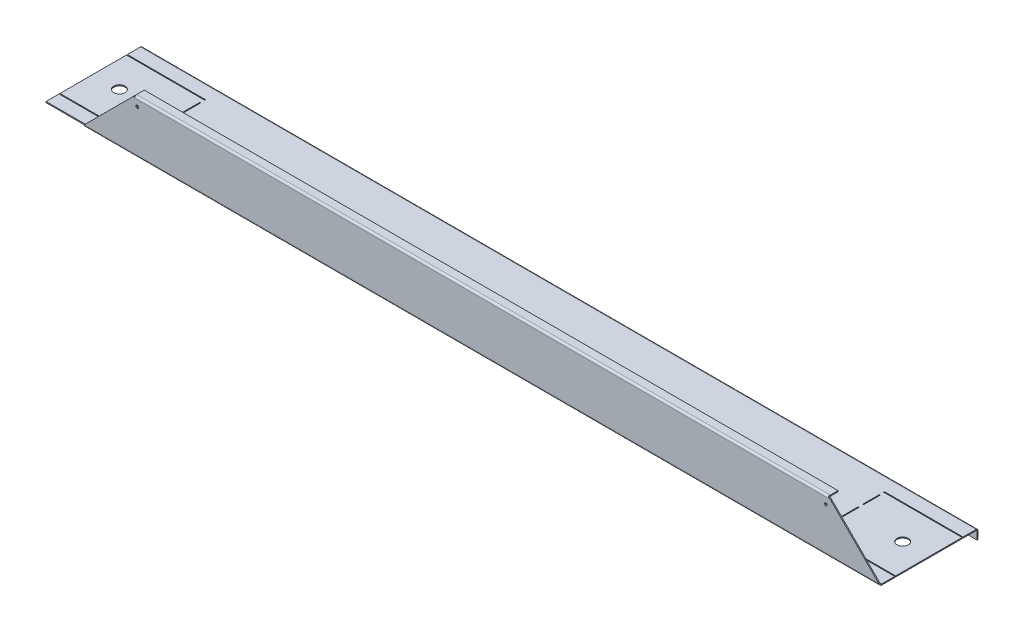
ISO-10303-21;
HEADER;
FILE_DESCRIPTION(('STEP AP214'),'2;1');
FILE_NAME('part.step','',(''),(''),'','','');
FILE_SCHEMA(('AUTOMOTIVE_DESIGN { 1 0 10303 214 1 1 1 1 }'));
ENDSEC;
DATA;
#1=APPLICATION_CONTEXT('core data for automotive mechanical design processes');
#2=APPLICATION_PROTOCOL_DEFINITION('international standard','automotive_design',2000,#1);
#3=PRODUCT_CONTEXT('',#1,'mechanical');
#4=PRODUCT('Part','Part','',(#3));
#5=PRODUCT_RELATED_PRODUCT_CATEGORY('part','',(#4));
#6=PRODUCT_DEFINITION_FORMATION('','',#4);
#7=PRODUCT_DEFINITION_CONTEXT('part definition',#1,'design');
#8=PRODUCT_DEFINITION('design','',#6,#7);
#9=PRODUCT_DEFINITION_SHAPE('','',#8);
#10=(LENGTH_UNIT() NAMED_UNIT(*) SI_UNIT(.MILLI.,.METRE.));
#11=(NAMED_UNIT(*) PLANE_ANGLE_UNIT() SI_UNIT($,.RADIAN.));
#12=(NAMED_UNIT(*) SI_UNIT($,.STERADIAN.) SOLID_ANGLE_UNIT());
#13=UNCERTAINTY_MEASURE_WITH_UNIT(LENGTH_MEASURE(1.E-05),#10,'distance_accuracy_value','');
#14=(GEOMETRIC_REPRESENTATION_CONTEXT(3) GLOBAL_UNCERTAINTY_ASSIGNED_CONTEXT((#13)) GLOBAL_UNIT_ASSIGNED_CONTEXT((#10,
#11,#12)) REPRESENTATION_CONTEXT('',''));
#15=CARTESIAN_POINT('',(0.,0.,0.));
#16=DIRECTION('',(0.,0.,1.));
#17=DIRECTION('',(1.,0.,0.));
#18=AXIS2_PLACEMENT_3D('',#15,#16,#17);
#19=CARTESIAN_POINT('',(-501.3,-1020.20000000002,-112.600000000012));
#20=DIRECTION('',(1.,0.,0.));
#21=DIRECTION('',(0.,0.,-1.));
#22=AXIS2_PLACEMENT_3D('',#19,#20,#21);
#23=PLANE('',#22);
#24=DIRECTION('',(0.,0.,-1.));
#25=VECTOR('',#24,1.);
#26=CARTESIAN_POINT('',(-501.299999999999,-1020.20000000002,4.57075433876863E-12));
#27=LINE('',#26,#25);
#28=CARTESIAN_POINT('',(-501.300000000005,-1020.20000000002,-95.3999999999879));
#29=VERTEX_POINT('',#28);
#30=CARTESIAN_POINT('',(-501.3,-1020.20000000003,-110.400000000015));
#31=VERTEX_POINT('',#30);
#32=EDGE_CURVE('E862',#29,#31,#27,.T.);
#33=ORIENTED_EDGE('',*,*,#32,.F.);
#34=DIRECTION('',(0.,-1.,0.));
#35=VECTOR('',#34,1.);
#36=CARTESIAN_POINT('',(-501.300000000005,-960.199,-95.3999999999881));
#37=LINE('',#36,#35);
#38=CARTESIAN_POINT('',(-501.3,-1019.00000000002,-95.3999999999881));
#39=VERTEX_POINT('',#38);
#40=EDGE_CURVE('E632',#39,#29,#37,.T.);
#41=ORIENTED_EDGE('',*,*,#40,.F.);
#42=DIRECTION('',(0.,0.,1.));
#43=VECTOR('',#42,1.);
#44=CARTESIAN_POINT('',(-501.3,-1019.00000000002,-112.600000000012));
#45=LINE('',#44,#43);
#46=CARTESIAN_POINT('',(-501.3,-1019.00000000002,-110.400000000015));
#47=VERTEX_POINT('',#46);
#48=EDGE_CURVE('E872',#39,#47,#45,.F.);
#49=ORIENTED_EDGE('',*,*,#48,.T.);
#50=DIRECTION('',(0.,1.,-1.54598556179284E-12));
#51=VECTOR('',#50,1.);
#52=CARTESIAN_POINT('',(-501.3,-1020.20000000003,-110.400000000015));
#53=LINE('',#52,#51);
#54=EDGE_CURVE('E846',#31,#47,#53,.T.);
#55=ORIENTED_EDGE('',*,*,#54,.F.);
#56=EDGE_LOOP('',(#33,#41,#49,#55));
#57=FACE_BOUND('',#56,.T.);
#58=ADVANCED_FACE('F101',(#57),#23,.F.);
#59=CARTESIAN_POINT('',(-501.299999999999,-1019.00000000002,-18.1999999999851));
#60=VERTEX_POINT('',#59);
#61=CARTESIAN_POINT('',(-501.3,-1019.00000000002,-94.3999999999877));
#62=VERTEX_POINT('',#61);
#63=EDGE_CURVE('E871',#60,#62,#45,.F.);
#64=ORIENTED_EDGE('',*,*,#63,.T.);
#65=DIRECTION('',(0.,-1.,0.));
#66=VECTOR('',#65,1.);
#67=CARTESIAN_POINT('',(-501.300000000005,-960.199,-94.399999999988));
#68=LINE('',#67,#66);
#69=CARTESIAN_POINT('',(-501.300000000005,-1020.20000000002,-94.3999999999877));
#70=VERTEX_POINT('',#69);
#71=EDGE_CURVE('E634',#62,#70,#68,.T.);
#72=ORIENTED_EDGE('',*,*,#71,.T.);
#73=CARTESIAN_POINT('',(-501.300000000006,-1020.20000000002,-18.1999999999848));
#74=VERTEX_POINT('',#73);
#75=EDGE_CURVE('E861',#74,#70,#27,.T.);
#76=ORIENTED_EDGE('',*,*,#75,.F.);
#77=DIRECTION('',(0.,-1.,0.));
#78=VECTOR('',#77,1.);
#79=CARTESIAN_POINT('',(-501.300000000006,-960.199,-18.1999999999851));
#80=LINE('',#79,#78);
#81=EDGE_CURVE('E574',#60,#74,#80,.T.);
#82=ORIENTED_EDGE('',*,*,#81,.F.);
#83=EDGE_LOOP('',(#64,#72,#76,#82));
#84=FACE_BOUND('',#83,.T.);
#85=ADVANCED_FACE('F947',(#84),#23,.F.);
#86=CARTESIAN_POINT('',(456.299999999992,-1020.20000000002,-1.19999999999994));
#87=DIRECTION('',(-1.,0.,0.));
#88=DIRECTION('',(0.,0.,1.));
#89=AXIS2_PLACEMENT_3D('',#86,#87,#88);
#90=PLANE('',#89);
#91=DIRECTION('',(0.,0.,-1.));
#92=VECTOR('',#91,1.);
#93=CARTESIAN_POINT('',(456.299999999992,-1019.00000000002,-1.19999999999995));
#94=LINE('',#93,#92);
#95=CARTESIAN_POINT('',(456.299999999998,-1019.00000000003,-110.400000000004));
#96=VERTEX_POINT('',#95);
#97=CARTESIAN_POINT('',(456.299999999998,-1019.00000000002,-95.3999999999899));
#98=VERTEX_POINT('',#97);
#99=EDGE_CURVE('E863',#96,#98,#94,.F.);
#100=ORIENTED_EDGE('',*,*,#99,.T.);
#101=DIRECTION('',(0.,-1.,0.));
#102=VECTOR('',#101,1.);
#103=CARTESIAN_POINT('',(456.299999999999,-960.199,-95.3999999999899));
#104=LINE('',#103,#102);
#105=CARTESIAN_POINT('',(456.299999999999,-1020.20000000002,-95.3999999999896));
#106=VERTEX_POINT('',#105);
#107=EDGE_CURVE('E702',#98,#106,#104,.T.);
#108=ORIENTED_EDGE('',*,*,#107,.T.);
#109=DIRECTION('',(0.,0.,1.));
#110=VECTOR('',#109,1.);
#111=CARTESIAN_POINT('',(456.299999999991,-1020.20000000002,3.34027180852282E-11));
#112=LINE('',#111,#110);
#113=CARTESIAN_POINT('',(456.299999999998,-1020.20000000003,-110.400000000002));
#114=VERTEX_POINT('',#113);
#115=EDGE_CURVE('E852',#114,#106,#112,.T.);
#116=ORIENTED_EDGE('',*,*,#115,.F.);
#117=DIRECTION('',(0.,1.,-1.54043444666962E-12));
#118=VECTOR('',#117,1.);
#119=CARTESIAN_POINT('',(456.299999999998,-1020.20000000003,-110.400000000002));
#120=LINE('',#119,#118);
#121=EDGE_CURVE('E835',#114,#96,#120,.T.);
#122=ORIENTED_EDGE('',*,*,#121,.T.);
#123=EDGE_LOOP('',(#100,#108,#116,#122));
#124=FACE_BOUND('',#123,.T.);
#125=ADVANCED_FACE('F952',(#124),#90,.F.);
#126=CARTESIAN_POINT('',(456.299999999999,-1020.20000000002,-94.3999999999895));
#127=VERTEX_POINT('',#126);
#128=CARTESIAN_POINT('',(456.299999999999,-1020.20000000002,-18.1999999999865));
#129=VERTEX_POINT('',#128);
#130=EDGE_CURVE('E856',#127,#129,#112,.T.);
#131=ORIENTED_EDGE('',*,*,#130,.F.);
#132=DIRECTION('',(0.,-1.,0.));
#133=VECTOR('',#132,1.);
#134=CARTESIAN_POINT('',(456.299999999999,-960.199,-94.3999999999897));
#135=LINE('',#134,#133);
#136=CARTESIAN_POINT('',(456.299999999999,-1019.00000000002,-94.3999999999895));
#137=VERTEX_POINT('',#136);
#138=EDGE_CURVE('E706',#137,#127,#135,.T.);
#139=ORIENTED_EDGE('',*,*,#138,.F.);
#140=CARTESIAN_POINT('',(456.299999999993,-1019.00000000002,-18.1999999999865));
#141=VERTEX_POINT('',#140);
#142=EDGE_CURVE('E866',#137,#141,#94,.F.);
#143=ORIENTED_EDGE('',*,*,#142,.T.);
#144=DIRECTION('',(0.,-1.,0.));
#145=VECTOR('',#144,1.);
#146=CARTESIAN_POINT('',(456.299999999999,-960.199,-18.1999999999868));
#147=LINE('',#146,#145);
#148=EDGE_CURVE('E786',#141,#129,#147,.T.);
#149=ORIENTED_EDGE('',*,*,#148,.T.);
#150=EDGE_LOOP('',(#131,#139,#143,#149));
#151=FACE_BOUND('',#150,.T.);
#152=ADVANCED_FACE('F957',(#151),#90,.F.);
#153=CARTESIAN_POINT('',(-501.299999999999,-1019.00000000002,-2.19999999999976));
#154=VERTEX_POINT('',#153);
#155=CARTESIAN_POINT('',(-501.299999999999,-1019.00000000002,-17.1999999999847));
#156=VERTEX_POINT('',#155);
#157=EDGE_CURVE('E868',#154,#156,#45,.F.);
#158=ORIENTED_EDGE('',*,*,#157,.T.);
#159=DIRECTION('',(0.,-1.,0.));
#160=VECTOR('',#159,1.);
#161=CARTESIAN_POINT('',(-501.300000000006,-960.199,-17.199999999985));
#162=LINE('',#161,#160);
#163=CARTESIAN_POINT('',(-501.300000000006,-1020.20000000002,-17.1999999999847));
#164=VERTEX_POINT('',#163);
#165=EDGE_CURVE('E576',#156,#164,#162,.T.);
#166=ORIENTED_EDGE('',*,*,#165,.T.);
#167=CARTESIAN_POINT('',(-501.299999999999,-1020.20000000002,-2.19999999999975));
#168=VERTEX_POINT('',#167);
#169=EDGE_CURVE('E858',#168,#164,#27,.T.);
#170=ORIENTED_EDGE('',*,*,#169,.F.);
#171=DIRECTION('',(0.,1.,0.));
#172=VECTOR('',#171,1.);
#173=CARTESIAN_POINT('',(-501.299999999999,-1019.00000000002,-2.19999999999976));
#174=LINE('',#173,#172);
#175=EDGE_CURVE('E875',#154,#168,#174,.F.);
#176=ORIENTED_EDGE('',*,*,#175,.F.);
#177=EDGE_LOOP('',(#158,#166,#170,#176));
#178=FACE_BOUND('',#177,.T.);
#179=ADVANCED_FACE('F934',(#178),#23,.F.);
#180=CARTESIAN_POINT('',(456.299999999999,-1020.20000000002,-17.1999999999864));
#181=VERTEX_POINT('',#180);
#182=CARTESIAN_POINT('',(456.299999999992,-1020.20000000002,-2.19999999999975));
#183=VERTEX_POINT('',#182);
#184=EDGE_CURVE('E857',#181,#183,#112,.T.);
#185=ORIENTED_EDGE('',*,*,#184,.F.);
#186=DIRECTION('',(0.,-1.,0.));
#187=VECTOR('',#186,1.);
#188=CARTESIAN_POINT('',(456.299999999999,-960.199,-17.1999999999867));
#189=LINE('',#188,#187);
#190=CARTESIAN_POINT('',(456.299999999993,-1019.00000000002,-17.1999999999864));
#191=VERTEX_POINT('',#190);
#192=EDGE_CURVE('E785',#191,#181,#189,.T.);
#193=ORIENTED_EDGE('',*,*,#192,.F.);
#194=CARTESIAN_POINT('',(456.299999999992,-1019.00000000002,-2.19999999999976));
#195=VERTEX_POINT('',#194);
#196=EDGE_CURVE('E867',#191,#195,#94,.F.);
#197=ORIENTED_EDGE('',*,*,#196,.T.);
#198=DIRECTION('',(0.,1.,0.));
#199=VECTOR('',#198,1.);
#200=CARTESIAN_POINT('',(456.299999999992,-1020.20000000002,-2.19999999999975));
#201=LINE('',#200,#199);
#202=EDGE_CURVE('E849',#195,#183,#201,.F.);
#203=ORIENTED_EDGE('',*,*,#202,.T.);
#204=EDGE_LOOP('',(#185,#193,#197,#203));
#205=FACE_BOUND('',#204,.T.);
#206=ADVANCED_FACE('F956',(#205),#90,.F.);
#207=CARTESIAN_POINT('',(0.,-1020.20000000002,4.07115397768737E-12));
#208=DIRECTION('',(0.,1.,0.));
#209=DIRECTION('',(0.,0.,1.));
#210=AXIS2_PLACEMENT_3D('',#207,#208,#209);
#211=PLANE('',#210);
#212=CARTESIAN_POINT('',(-471.300000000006,-1020.20000000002,-56.2999999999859));
#213=DIRECTION('',(0.,-1.,0.));
#214=DIRECTION('',(0.,0.,1.));
#215=AXIS2_PLACEMENT_3D('',#212,#213,#214);
#216=CIRCLE('',#215,6.50000000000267);
#217=CARTESIAN_POINT('',(-471.300000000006,-1020.20000000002,-49.7999999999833));
#218=VERTEX_POINT('',#217);
#219=EDGE_CURVE('E640',#218,#218,#216,.T.);
#220=ORIENTED_EDGE('',*,*,#219,.F.);
#221=EDGE_LOOP('',(#220));
#222=FACE_BOUND('',#221,.T.);
#223=CARTESIAN_POINT('',(426.3,-1020.20000000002,-56.2999999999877));
#224=DIRECTION('',(0.,-1.,0.));
#225=DIRECTION('',(0.,0.,-1.));
#226=AXIS2_PLACEMENT_3D('',#223,#224,#225);
#227=CIRCLE('',#226,6.50000000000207);
#228=CARTESIAN_POINT('',(426.3,-1020.20000000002,-62.7999999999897));
#229=VERTEX_POINT('',#228);
#230=EDGE_CURVE('E647',#229,#229,#227,.T.);
#231=ORIENTED_EDGE('',*,*,#230,.F.);
#232=EDGE_LOOP('',(#231));
#233=FACE_BOUND('',#232,.T.);
#234=DIRECTION('',(0.,0.,1.));
#235=VECTOR('',#234,1.);
#236=CARTESIAN_POINT('',(-411.300000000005,-1020.20000000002,-23.1999999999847));
#237=LINE('',#236,#235);
#238=CARTESIAN_POINT('',(-411.300000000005,-1020.20000000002,-41.9333333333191));
#239=VERTEX_POINT('',#238);
#240=CARTESIAN_POINT('',(-411.300000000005,-1020.20000000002,-23.1999999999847));
#241=VERTEX_POINT('',#240);
#242=EDGE_CURVE('E595',#239,#241,#237,.T.);
#243=ORIENTED_EDGE('',*,*,#242,.F.);
#244=DIRECTION('',(1.,0.,0.));
#245=VECTOR('',#244,1.);
#246=CARTESIAN_POINT('',(-411.300000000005,-1020.20000000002,-41.9333333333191));
#247=LINE('',#246,#245);
#248=CARTESIAN_POINT('',(-412.300000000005,-1020.20000000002,-41.9333333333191));
#249=VERTEX_POINT('',#248);
#250=EDGE_CURVE('E118',#249,#239,#247,.T.);
#251=ORIENTED_EDGE('',*,*,#250,.F.);
#252=DIRECTION('',(0.,0.,-1.));
#253=VECTOR('',#252,1.);
#254=CARTESIAN_POINT('',(-412.300000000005,-1020.20000000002,-41.9333333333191));
#255=LINE('',#254,#253);
#256=CARTESIAN_POINT('',(-412.300000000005,-1020.20000000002,-23.1999999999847));
#257=VERTEX_POINT('',#256);
#258=EDGE_CURVE('E601',#257,#249,#255,.T.);
#259=ORIENTED_EDGE('',*,*,#258,.F.);
#260=DIRECTION('',(-1.,0.,0.));
#261=VECTOR('',#260,1.);
#262=CARTESIAN_POINT('',(-412.300000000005,-1020.20000000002,-23.1999999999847));
#263=LINE('',#262,#261);
#264=EDGE_CURVE('E598',#241,#257,#263,.T.);
#265=ORIENTED_EDGE('',*,*,#264,.F.);
#266=EDGE_LOOP('',(#243,#251,#259,#265));
#267=FACE_BOUND('',#266,.T.);
#268=DIRECTION('',(0.,0.,1.));
#269=VECTOR('',#268,1.);
#270=CARTESIAN_POINT('',(367.299999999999,-1020.20000000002,-89.3999999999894));
#271=LINE('',#270,#269);
#272=CARTESIAN_POINT('',(367.299999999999,-1020.20000000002,-89.3999999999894));
#273=VERTEX_POINT('',#272);
#274=CARTESIAN_POINT('',(367.299999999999,-1020.20000000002,-70.6666666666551));
#275=VERTEX_POINT('',#274);
#276=EDGE_CURVE('E721',#273,#275,#271,.T.);
#277=ORIENTED_EDGE('',*,*,#276,.F.);
#278=DIRECTION('',(1.,0.,0.));
#279=VECTOR('',#278,1.);
#280=CARTESIAN_POINT('',(366.299999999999,-1020.20000000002,-89.3999999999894));
#281=LINE('',#280,#279);
#282=CARTESIAN_POINT('',(366.299999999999,-1020.20000000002,-89.3999999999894));
#283=VERTEX_POINT('',#282);
#284=EDGE_CURVE('E126',#283,#273,#281,.T.);
#285=ORIENTED_EDGE('',*,*,#284,.F.);
#286=DIRECTION('',(0.,0.,-1.));
#287=VECTOR('',#286,1.);
#288=CARTESIAN_POINT('',(366.299999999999,-1020.20000000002,-70.6666666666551));
#289=LINE('',#288,#287);
#290=CARTESIAN_POINT('',(366.299999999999,-1020.20000000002,-70.6666666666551));
#291=VERTEX_POINT('',#290);
#292=EDGE_CURVE('E727',#291,#283,#289,.T.);
#293=ORIENTED_EDGE('',*,*,#292,.F.);
#294=DIRECTION('',(-1.,0.,0.));
#295=VECTOR('',#294,1.);
#296=CARTESIAN_POINT('',(367.299999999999,-1020.20000000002,-70.6666666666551));
#297=LINE('',#296,#295);
#298=EDGE_CURVE('E724',#275,#291,#297,.T.);
#299=ORIENTED_EDGE('',*,*,#298,.F.);
#300=EDGE_LOOP('',(#277,#285,#293,#299));
#301=FACE_BOUND('',#300,.T.);
#302=DIRECTION('',(0.,0.,1.));
#303=VECTOR('',#302,1.);
#304=CARTESIAN_POINT('',(367.299999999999,-1020.20000000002,-65.6666666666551));
#305=LINE('',#304,#303);
#306=CARTESIAN_POINT('',(367.299999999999,-1020.20000000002,-65.6666666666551));
#307=VERTEX_POINT('',#306);
#308=CARTESIAN_POINT('',(367.299999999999,-1020.20000000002,-46.9333333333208));
#309=VERTEX_POINT('',#308);
#310=EDGE_CURVE('E752',#307,#309,#305,.T.);
#311=ORIENTED_EDGE('',*,*,#310,.F.);
#312=DIRECTION('',(1.,0.,0.));
#313=VECTOR('',#312,1.);
#314=CARTESIAN_POINT('',(366.299999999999,-1020.20000000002,-65.6666666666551));
#315=LINE('',#314,#313);
#316=CARTESIAN_POINT('',(366.299999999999,-1020.20000000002,-65.6666666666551));
#317=VERTEX_POINT('',#316);
#318=EDGE_CURVE('E750',#317,#307,#315,.T.);
#319=ORIENTED_EDGE('',*,*,#318,.F.);
#320=DIRECTION('',(0.,0.,-1.));
#321=VECTOR('',#320,1.);
#322=CARTESIAN_POINT('',(366.299999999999,-1020.20000000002,-46.9333333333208));
#323=LINE('',#322,#321);
#324=CARTESIAN_POINT('',(366.299999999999,-1020.20000000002,-46.9333333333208));
#325=VERTEX_POINT('',#324);
#326=EDGE_CURVE('E758',#325,#317,#323,.T.);
#327=ORIENTED_EDGE('',*,*,#326,.F.);
#328=DIRECTION('',(-1.,0.,0.));
#329=VECTOR('',#328,1.);
#330=CARTESIAN_POINT('',(367.299999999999,-1020.20000000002,-46.9333333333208));
#331=LINE('',#330,#329);
#332=EDGE_CURVE('E755',#309,#325,#331,.T.);
#333=ORIENTED_EDGE('',*,*,#332,.F.);
#334=EDGE_LOOP('',(#311,#319,#327,#333));
#335=FACE_BOUND('',#334,.T.);
#336=DIRECTION('',(0.,0.,1.));
#337=VECTOR('',#336,1.);
#338=CARTESIAN_POINT('',(367.299999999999,-1020.20000000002,-41.9333333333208));
#339=LINE('',#338,#337);
#340=CARTESIAN_POINT('',(367.299999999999,-1020.20000000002,-41.9333333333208));
#341=VERTEX_POINT('',#340);
#342=CARTESIAN_POINT('',(367.299999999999,-1020.20000000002,-23.1999999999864));
#343=VERTEX_POINT('',#342);
#344=EDGE_CURVE('E664',#341,#343,#339,.T.);
#345=ORIENTED_EDGE('',*,*,#344,.F.);
#346=DIRECTION('',(1.,0.,0.));
#347=VECTOR('',#346,1.);
#348=CARTESIAN_POINT('',(366.299999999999,-1020.20000000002,-41.9333333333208));
#349=LINE('',#348,#347);
#350=CARTESIAN_POINT('',(366.299999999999,-1020.20000000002,-41.9333333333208));
#351=VERTEX_POINT('',#350);
#352=EDGE_CURVE('E662',#351,#341,#349,.T.);
#353=ORIENTED_EDGE('',*,*,#352,.F.);
#354=DIRECTION('',(0.,0.,-1.));
#355=VECTOR('',#354,1.);
#356=CARTESIAN_POINT('',(366.299999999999,-1020.20000000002,-23.1999999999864));
#357=LINE('',#356,#355);
#358=CARTESIAN_POINT('',(366.299999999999,-1020.20000000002,-23.1999999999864));
#359=VERTEX_POINT('',#358);
#360=EDGE_CURVE('E670',#359,#351,#357,.T.);
#361=ORIENTED_EDGE('',*,*,#360,.F.);
#362=DIRECTION('',(-1.,0.,0.));
#363=VECTOR('',#362,1.);
#364=CARTESIAN_POINT('',(367.299999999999,-1020.20000000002,-23.1999999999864));
#365=LINE('',#364,#363);
#366=EDGE_CURVE('E667',#343,#359,#365,.T.);
#367=ORIENTED_EDGE('',*,*,#366,.F.);
#368=EDGE_LOOP('',(#345,#353,#361,#367));
#369=FACE_BOUND('',#368,.T.);
#370=DIRECTION('',(0.,0.,1.));
#371=VECTOR('',#370,1.);
#372=CARTESIAN_POINT('',(-411.300000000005,-1020.20000000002,-46.9333333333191));
#373=LINE('',#372,#371);
#374=CARTESIAN_POINT('',(-411.300000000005,-1020.20000000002,-65.6666666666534));
#375=VERTEX_POINT('',#374);
#376=CARTESIAN_POINT('',(-411.300000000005,-1020.20000000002,-46.9333333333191));
#377=VERTEX_POINT('',#376);
#378=EDGE_CURVE('E509',#375,#377,#373,.T.);
#379=ORIENTED_EDGE('',*,*,#378,.F.);
#380=DIRECTION('',(1.,0.,0.));
#381=VECTOR('',#380,1.);
#382=CARTESIAN_POINT('',(-411.300000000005,-1020.20000000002,-65.6666666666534));
#383=LINE('',#382,#381);
#384=CARTESIAN_POINT('',(-412.300000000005,-1020.20000000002,-65.6666666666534));
#385=VERTEX_POINT('',#384);
#386=EDGE_CURVE('E501',#385,#375,#383,.T.);
#387=ORIENTED_EDGE('',*,*,#386,.F.);
#388=DIRECTION('',(0.,0.,-1.));
#389=VECTOR('',#388,1.);
#390=CARTESIAN_POINT('',(-412.300000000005,-1020.20000000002,-65.6666666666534));
#391=LINE('',#390,#389);
#392=CARTESIAN_POINT('',(-412.300000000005,-1020.20000000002,-46.9333333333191));
#393=VERTEX_POINT('',#392);
#394=EDGE_CURVE('E502',#393,#385,#391,.T.);
#395=ORIENTED_EDGE('',*,*,#394,.F.);
#396=DIRECTION('',(-1.,0.,0.));
#397=VECTOR('',#396,1.);
#398=CARTESIAN_POINT('',(-412.300000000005,-1020.20000000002,-46.9333333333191));
#399=LINE('',#398,#397);
#400=EDGE_CURVE('E516',#377,#393,#399,.T.);
#401=ORIENTED_EDGE('',*,*,#400,.F.);
#402=EDGE_LOOP('',(#379,#387,#395,#401));
#403=FACE_BOUND('',#402,.T.);
#404=DIRECTION('',(0.,0.,1.));
#405=VECTOR('',#404,1.);
#406=CARTESIAN_POINT('',(-411.300000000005,-1020.20000000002,-70.6666666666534));
#407=LINE('',#406,#405);
#408=CARTESIAN_POINT('',(-411.300000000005,-1020.20000000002,-89.3999999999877));
#409=VERTEX_POINT('',#408);
#410=CARTESIAN_POINT('',(-411.300000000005,-1020.20000000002,-70.6666666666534));
#411=VERTEX_POINT('',#410);
#412=EDGE_CURVE('E537',#409,#411,#407,.T.);
#413=ORIENTED_EDGE('',*,*,#412,.F.);
#414=DIRECTION('',(1.,0.,0.));
#415=VECTOR('',#414,1.);
#416=CARTESIAN_POINT('',(-411.300000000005,-1020.20000000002,-89.3999999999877));
#417=LINE('',#416,#415);
#418=CARTESIAN_POINT('',(-412.300000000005,-1020.20000000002,-89.3999999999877));
#419=VERTEX_POINT('',#418);
#420=EDGE_CURVE('E535',#419,#409,#417,.T.);
#421=ORIENTED_EDGE('',*,*,#420,.F.);
#422=DIRECTION('',(0.,0.,-1.));
#423=VECTOR('',#422,1.);
#424=CARTESIAN_POINT('',(-412.300000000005,-1020.20000000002,-89.3999999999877));
#425=LINE('',#424,#423);
#426=CARTESIAN_POINT('',(-412.300000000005,-1020.20000000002,-70.6666666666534));
#427=VERTEX_POINT('',#426);
#428=EDGE_CURVE('E543',#427,#419,#425,.T.);
#429=ORIENTED_EDGE('',*,*,#428,.F.);
#430=DIRECTION('',(-1.,0.,0.));
#431=VECTOR('',#430,1.);
#432=CARTESIAN_POINT('',(-412.300000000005,-1020.20000000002,-70.6666666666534));
#433=LINE('',#432,#431);
#434=EDGE_CURVE('E540',#411,#427,#433,.T.);
#435=ORIENTED_EDGE('',*,*,#434,.F.);
#436=EDGE_LOOP('',(#413,#421,#429,#435));
#437=FACE_BOUND('',#436,.T.);
#438=DIRECTION('',(0.,0.,1.));
#439=VECTOR('',#438,1.);
#440=CARTESIAN_POINT('',(-411.300000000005,-1020.20000000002,-94.3999999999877));
#441=LINE('',#440,#439);
#442=CARTESIAN_POINT('',(-411.300000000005,-1020.20000000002,-95.3999999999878));
#443=VERTEX_POINT('',#442);
#444=CARTESIAN_POINT('',(-411.300000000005,-1020.20000000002,-94.3999999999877));
#445=VERTEX_POINT('',#444);
#446=EDGE_CURVE('E621',#443,#445,#441,.T.);
#447=ORIENTED_EDGE('',*,*,#446,.F.);
#448=DIRECTION('',(1.,0.,0.));
#449=VECTOR('',#448,1.);
#450=CARTESIAN_POINT('',(-411.300000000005,-1020.20000000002,-95.3999999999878));
#451=LINE('',#450,#449);
#452=EDGE_CURVE('E626',#29,#443,#451,.T.);
#453=ORIENTED_EDGE('',*,*,#452,.F.);
#454=ORIENTED_EDGE('',*,*,#32,.T.);
#455=DIRECTION('',(1.,0.,0.));
#456=VECTOR('',#455,1.);
#457=CARTESIAN_POINT('',(456.299999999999,-1020.20000000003,-110.400000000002));
#458=LINE('',#457,#456);
#459=EDGE_CURVE('E841',#114,#31,#458,.F.);
#460=ORIENTED_EDGE('',*,*,#459,.F.);
#461=ORIENTED_EDGE('',*,*,#115,.T.);
#462=DIRECTION('',(1.,0.,0.));
#463=VECTOR('',#462,1.);
#464=CARTESIAN_POINT('',(366.299999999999,-1020.20000000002,-95.3999999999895));
#465=LINE('',#464,#463);
#466=CARTESIAN_POINT('',(366.299999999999,-1020.20000000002,-95.3999999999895));
#467=VERTEX_POINT('',#466);
#468=EDGE_CURVE('E694',#467,#106,#465,.T.);
#469=ORIENTED_EDGE('',*,*,#468,.F.);
#470=DIRECTION('',(0.,0.,-1.));
#471=VECTOR('',#470,1.);
#472=CARTESIAN_POINT('',(366.299999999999,-1020.20000000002,-94.3999999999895));
#473=LINE('',#472,#471);
#474=CARTESIAN_POINT('',(366.299999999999,-1020.20000000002,-94.3999999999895));
#475=VERTEX_POINT('',#474);
#476=EDGE_CURVE('E699',#475,#467,#473,.T.);
#477=ORIENTED_EDGE('',*,*,#476,.F.);
#478=DIRECTION('',(-1.,0.,0.));
#479=VECTOR('',#478,1.);
#480=CARTESIAN_POINT('',(456.299999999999,-1020.20000000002,-94.3999999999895));
#481=LINE('',#480,#479);
#482=EDGE_CURVE('E696',#127,#475,#481,.T.);
#483=ORIENTED_EDGE('',*,*,#482,.F.);
#484=ORIENTED_EDGE('',*,*,#130,.T.);
#485=DIRECTION('',(1.,0.,0.));
#486=VECTOR('',#485,1.);
#487=CARTESIAN_POINT('',(366.299999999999,-1020.20000000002,-18.1999999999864));
#488=LINE('',#487,#486);
#489=CARTESIAN_POINT('',(366.299999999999,-1020.20000000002,-18.1999999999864));
#490=VERTEX_POINT('',#489);
#491=EDGE_CURVE('E783',#490,#129,#488,.T.);
#492=ORIENTED_EDGE('',*,*,#491,.F.);
#493=DIRECTION('',(0.,0.,-1.));
#494=VECTOR('',#493,1.);
#495=CARTESIAN_POINT('',(366.299999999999,-1020.20000000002,-17.1999999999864));
#496=LINE('',#495,#494);
#497=CARTESIAN_POINT('',(366.299999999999,-1020.20000000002,-17.1999999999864));
#498=VERTEX_POINT('',#497);
#499=EDGE_CURVE('E780',#498,#490,#496,.T.);
#500=ORIENTED_EDGE('',*,*,#499,.F.);
#501=DIRECTION('',(-1.,0.,0.));
#502=VECTOR('',#501,1.);
#503=CARTESIAN_POINT('',(456.299999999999,-1020.20000000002,-17.1999999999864));
#504=LINE('',#503,#502);
#505=EDGE_CURVE('E777',#181,#498,#504,.T.);
#506=ORIENTED_EDGE('',*,*,#505,.F.);
#507=ORIENTED_EDGE('',*,*,#184,.T.);
#508=DIRECTION('',(-1.,0.,0.));
#509=VECTOR('',#508,1.);
#510=CARTESIAN_POINT('',(-455.300000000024,-1020.20000000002,-2.19999999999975));
#511=LINE('',#510,#509);
#512=CARTESIAN_POINT('',(-455.300000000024,-1020.20000000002,-2.19999999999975));
#513=VERTEX_POINT('',#512);
#514=EDGE_CURVE('E887',#183,#513,#511,.T.);
#515=ORIENTED_EDGE('',*,*,#514,.T.);
#516=DIRECTION('',(-1.,0.,0.));
#517=VECTOR('',#516,1.);
#518=CARTESIAN_POINT('',(456.299999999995,-1020.20000000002,-2.19999999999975));
#519=LINE('',#518,#517);
#520=EDGE_CURVE('E873',#168,#513,#519,.F.);
#521=ORIENTED_EDGE('',*,*,#520,.F.);
#522=ORIENTED_EDGE('',*,*,#169,.T.);
#523=DIRECTION('',(-1.,0.,0.));
#524=VECTOR('',#523,1.);
#525=CARTESIAN_POINT('',(-501.300000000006,-1020.20000000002,-17.1999999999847));
#526=LINE('',#525,#524);
#527=CARTESIAN_POINT('',(-411.300000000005,-1020.20000000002,-17.1999999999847));
#528=VERTEX_POINT('',#527);
#529=EDGE_CURVE('E571',#528,#164,#526,.T.);
#530=ORIENTED_EDGE('',*,*,#529,.F.);
#531=DIRECTION('',(0.,0.,1.));
#532=VECTOR('',#531,1.);
#533=CARTESIAN_POINT('',(-411.300000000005,-1020.20000000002,-17.1999999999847));
#534=LINE('',#533,#532);
#535=CARTESIAN_POINT('',(-411.300000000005,-1020.20000000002,-18.1999999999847));
#536=VERTEX_POINT('',#535);
#537=EDGE_CURVE('E568',#536,#528,#534,.T.);
#538=ORIENTED_EDGE('',*,*,#537,.F.);
#539=DIRECTION('',(1.,0.,0.));
#540=VECTOR('',#539,1.);
#541=CARTESIAN_POINT('',(-411.300000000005,-1020.20000000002,-18.1999999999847));
#542=LINE('',#541,#540);
#543=EDGE_CURVE('E565',#74,#536,#542,.T.);
#544=ORIENTED_EDGE('',*,*,#543,.F.);
#545=ORIENTED_EDGE('',*,*,#75,.T.);
#546=DIRECTION('',(-1.,0.,0.));
#547=VECTOR('',#546,1.);
#548=CARTESIAN_POINT('',(-501.300000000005,-1020.20000000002,-94.3999999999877));
#549=LINE('',#548,#547);
#550=EDGE_CURVE('E624',#445,#70,#549,.T.);
#551=ORIENTED_EDGE('',*,*,#550,.F.);
#552=EDGE_LOOP('',(#447,#453,#454,#460,#461,#469,#477,#483,#484,#492,#500,#506,#507,#515,#521,
#522,#530,#538,#544,#545,#551));
#553=FACE_BOUND('',#552,.T.);
#554=ADVANCED_FACE('F963',(#222,#233,#267,#301,#335,#369,#403,#437,#553),#211,.F.);
#555=CARTESIAN_POINT('',(0.,-1019.00000000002,4.06696420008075E-12));
#556=DIRECTION('',(0.,1.,0.));
#557=DIRECTION('',(0.,0.,1.));
#558=AXIS2_PLACEMENT_3D('',#555,#556,#557);
#559=PLANE('',#558);
#560=CARTESIAN_POINT('',(-471.300000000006,-1019.00000000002,-56.2999999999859));
#561=DIRECTION('',(0.,1.,0.));
#562=DIRECTION('',(0.,0.,1.));
#563=AXIS2_PLACEMENT_3D('',#560,#561,#562);
#564=CIRCLE('',#563,6.50000000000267);
#565=CARTESIAN_POINT('',(-471.300000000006,-1019.00000000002,-49.7999999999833));
#566=VERTEX_POINT('',#565);
#567=EDGE_CURVE('E644',#566,#566,#564,.F.);
#568=ORIENTED_EDGE('',*,*,#567,.T.);
#569=EDGE_LOOP('',(#568));
#570=FACE_BOUND('',#569,.T.);
#571=CARTESIAN_POINT('',(426.3,-1019.00000000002,-56.2999999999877));
#572=DIRECTION('',(0.,1.,0.));
#573=DIRECTION('',(0.,0.,1.));
#574=AXIS2_PLACEMENT_3D('',#571,#572,#573);
#575=CIRCLE('',#574,6.50000000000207);
#576=CARTESIAN_POINT('',(426.3,-1019.00000000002,-49.7999999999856));
#577=VERTEX_POINT('',#576);
#578=EDGE_CURVE('E615',#577,#577,#575,.F.);
#579=ORIENTED_EDGE('',*,*,#578,.T.);
#580=EDGE_LOOP('',(#579));
#581=FACE_BOUND('',#580,.T.);
#582=DIRECTION('',(1.,0.,0.));
#583=VECTOR('',#582,1.);
#584=CARTESIAN_POINT('',(-411.300000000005,-1019.00000000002,-41.9333333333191));
#585=LINE('',#584,#583);
#586=CARTESIAN_POINT('',(-412.300000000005,-1019.00000000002,-41.9333333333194));
#587=VERTEX_POINT('',#586);
#588=CARTESIAN_POINT('',(-411.300000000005,-1019.00000000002,-41.9333333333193));
#589=VERTEX_POINT('',#588);
#590=EDGE_CURVE('E591',#587,#589,#585,.T.);
#591=ORIENTED_EDGE('',*,*,#590,.T.);
#592=DIRECTION('',(0.,0.,1.));
#593=VECTOR('',#592,1.);
#594=CARTESIAN_POINT('',(-411.300000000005,-1019.00000000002,-23.1999999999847));
#595=LINE('',#594,#593);
#596=CARTESIAN_POINT('',(-411.300000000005,-1019.00000000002,-23.1999999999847));
#597=VERTEX_POINT('',#596);
#598=EDGE_CURVE('E607',#589,#597,#595,.T.);
#599=ORIENTED_EDGE('',*,*,#598,.T.);
#600=DIRECTION('',(-1.,0.,0.));
#601=VECTOR('',#600,1.);
#602=CARTESIAN_POINT('',(-412.300000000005,-1019.00000000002,-23.1999999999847));
#603=LINE('',#602,#601);
#604=CARTESIAN_POINT('',(-412.300000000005,-1019.00000000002,-23.1999999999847));
#605=VERTEX_POINT('',#604);
#606=EDGE_CURVE('E584',#597,#605,#603,.T.);
#607=ORIENTED_EDGE('',*,*,#606,.T.);
#608=DIRECTION('',(0.,0.,-1.));
#609=VECTOR('',#608,1.);
#610=CARTESIAN_POINT('',(-412.300000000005,-1019.00000000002,-41.9333333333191));
#611=LINE('',#610,#609);
#612=EDGE_CURVE('E587',#605,#587,#611,.T.);
#613=ORIENTED_EDGE('',*,*,#612,.T.);
#614=EDGE_LOOP('',(#591,#599,#607,#613));
#615=FACE_BOUND('',#614,.T.);
#616=DIRECTION('',(1.,0.,0.));
#617=VECTOR('',#616,1.);
#618=CARTESIAN_POINT('',(-411.300000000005,-1019.00000000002,-95.3999999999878));
#619=LINE('',#618,#617);
#620=CARTESIAN_POINT('',(-411.300000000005,-1019.00000000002,-95.3999999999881));
#621=VERTEX_POINT('',#620);
#622=EDGE_CURVE('E618',#39,#621,#619,.T.);
#623=ORIENTED_EDGE('',*,*,#622,.T.);
#624=DIRECTION('',(0.,0.,1.));
#625=VECTOR('',#624,1.);
#626=CARTESIAN_POINT('',(-411.300000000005,-1019.00000000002,-94.3999999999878));
#627=LINE('',#626,#625);
#628=CARTESIAN_POINT('',(-411.300000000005,-1019.00000000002,-94.3999999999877));
#629=VERTEX_POINT('',#628);
#630=EDGE_CURVE('E493',#621,#629,#627,.T.);
#631=ORIENTED_EDGE('',*,*,#630,.T.);
#632=DIRECTION('',(-1.,0.,0.));
#633=VECTOR('',#632,1.);
#634=CARTESIAN_POINT('',(-501.300000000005,-1019.00000000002,-94.3999999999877));
#635=LINE('',#634,#633);
#636=EDGE_CURVE('E588',#629,#62,#635,.T.);
#637=ORIENTED_EDGE('',*,*,#636,.T.);
#638=ORIENTED_EDGE('',*,*,#63,.F.);
#639=DIRECTION('',(1.,0.,0.));
#640=VECTOR('',#639,1.);
#641=CARTESIAN_POINT('',(-411.300000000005,-1019.00000000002,-18.1999999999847));
#642=LINE('',#641,#640);
#643=CARTESIAN_POINT('',(-411.300000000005,-1019.00000000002,-18.1999999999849));
#644=VERTEX_POINT('',#643);
#645=EDGE_CURVE('E561',#60,#644,#642,.T.);
#646=ORIENTED_EDGE('',*,*,#645,.T.);
#647=DIRECTION('',(0.,0.,1.));
#648=VECTOR('',#647,1.);
#649=CARTESIAN_POINT('',(-411.300000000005,-1019.00000000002,-17.1999999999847));
#650=LINE('',#649,#648);
#651=CARTESIAN_POINT('',(-411.300000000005,-1019.00000000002,-17.1999999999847));
#652=VERTEX_POINT('',#651);
#653=EDGE_CURVE('E529',#644,#652,#650,.T.);
#654=ORIENTED_EDGE('',*,*,#653,.T.);
#655=DIRECTION('',(-1.,0.,0.));
#656=VECTOR('',#655,1.);
#657=CARTESIAN_POINT('',(-501.300000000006,-1019.00000000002,-17.1999999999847));
#658=LINE('',#657,#656);
#659=EDGE_CURVE('E558',#652,#156,#658,.T.);
#660=ORIENTED_EDGE('',*,*,#659,.T.);
#661=ORIENTED_EDGE('',*,*,#157,.F.);
#662=DIRECTION('',(-1.,0.,0.));
#663=VECTOR('',#662,1.);
#664=CARTESIAN_POINT('',(456.299999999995,-1019.00000000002,-2.19999999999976));
#665=LINE('',#664,#663);
#666=CARTESIAN_POINT('',(-455.300000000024,-1019.00000000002,-2.19999999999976));
#667=VERTEX_POINT('',#666);
#668=EDGE_CURVE('E880',#667,#154,#665,.T.);
#669=ORIENTED_EDGE('',*,*,#668,.F.);
#670=EDGE_CURVE('E877',#195,#667,#665,.T.);
#671=ORIENTED_EDGE('',*,*,#670,.F.);
#672=ORIENTED_EDGE('',*,*,#196,.F.);
#673=DIRECTION('',(-1.,0.,0.));
#674=VECTOR('',#673,1.);
#675=CARTESIAN_POINT('',(456.299999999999,-1019.00000000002,-17.1999999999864));
#676=LINE('',#675,#674);
#677=CARTESIAN_POINT('',(366.299999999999,-1019.00000000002,-17.1999999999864));
#678=VERTEX_POINT('',#677);
#679=EDGE_CURVE('E789',#191,#678,#676,.T.);
#680=ORIENTED_EDGE('',*,*,#679,.T.);
#681=DIRECTION('',(0.,0.,-1.));
#682=VECTOR('',#681,1.);
#683=CARTESIAN_POINT('',(366.299999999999,-1019.00000000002,-17.1999999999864));
#684=LINE('',#683,#682);
#685=CARTESIAN_POINT('',(366.299999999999,-1019.00000000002,-18.1999999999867));
#686=VERTEX_POINT('',#685);
#687=EDGE_CURVE('E741',#678,#686,#684,.T.);
#688=ORIENTED_EDGE('',*,*,#687,.T.);
#689=DIRECTION('',(1.,0.,0.));
#690=VECTOR('',#689,1.);
#691=CARTESIAN_POINT('',(366.299999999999,-1019.00000000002,-18.1999999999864));
#692=LINE('',#691,#690);
#693=EDGE_CURVE('E774',#686,#141,#692,.T.);
#694=ORIENTED_EDGE('',*,*,#693,.T.);
#695=ORIENTED_EDGE('',*,*,#142,.F.);
#696=DIRECTION('',(-1.,0.,0.));
#697=VECTOR('',#696,1.);
#698=CARTESIAN_POINT('',(456.299999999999,-1019.00000000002,-94.3999999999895));
#699=LINE('',#698,#697);
#700=CARTESIAN_POINT('',(366.299999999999,-1019.00000000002,-94.3999999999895));
#701=VERTEX_POINT('',#700);
#702=EDGE_CURVE('E643',#137,#701,#699,.T.);
#703=ORIENTED_EDGE('',*,*,#702,.T.);
#704=DIRECTION('',(0.,0.,-1.));
#705=VECTOR('',#704,1.);
#706=CARTESIAN_POINT('',(366.299999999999,-1019.00000000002,-94.3999999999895));
#707=LINE('',#706,#705);
#708=CARTESIAN_POINT('',(366.299999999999,-1019.00000000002,-95.3999999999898));
#709=VERTEX_POINT('',#708);
#710=EDGE_CURVE('E688',#701,#709,#707,.T.);
#711=ORIENTED_EDGE('',*,*,#710,.T.);
#712=DIRECTION('',(1.,0.,0.));
#713=VECTOR('',#712,1.);
#714=CARTESIAN_POINT('',(366.299999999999,-1019.00000000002,-95.3999999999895));
#715=LINE('',#714,#713);
#716=EDGE_CURVE('E691',#709,#98,#715,.T.);
#717=ORIENTED_EDGE('',*,*,#716,.T.);
#718=ORIENTED_EDGE('',*,*,#99,.F.);
#719=DIRECTION('',(1.,0.,0.));
#720=VECTOR('',#719,1.);
#721=CARTESIAN_POINT('',(456.299999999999,-1019.00000000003,-110.400000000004));
#722=LINE('',#721,#720);
#723=EDGE_CURVE('E828',#96,#47,#722,.F.);
#724=ORIENTED_EDGE('',*,*,#723,.T.);
#725=ORIENTED_EDGE('',*,*,#48,.F.);
#726=EDGE_LOOP('',(#623,#631,#637,#638,#646,#654,#660,#661,#669,#671,#672,#680,#688,#694,#695,
#703,#711,#717,#718,#724,#725));
#727=FACE_BOUND('',#726,.T.);
#728=DIRECTION('',(1.,0.,0.));
#729=VECTOR('',#728,1.);
#730=CARTESIAN_POINT('',(366.299999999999,-1019.00000000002,-89.3999999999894));
#731=LINE('',#730,#729);
#732=CARTESIAN_POINT('',(366.299999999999,-1019.00000000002,-89.3999999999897));
#733=VERTEX_POINT('',#732);
#734=CARTESIAN_POINT('',(367.299999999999,-1019.00000000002,-89.3999999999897));
#735=VERTEX_POINT('',#734);
#736=EDGE_CURVE('E717',#733,#735,#731,.T.);
#737=ORIENTED_EDGE('',*,*,#736,.T.);
#738=DIRECTION('',(0.,0.,1.));
#739=VECTOR('',#738,1.);
#740=CARTESIAN_POINT('',(367.299999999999,-1019.00000000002,-89.3999999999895));
#741=LINE('',#740,#739);
#742=CARTESIAN_POINT('',(367.299999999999,-1019.00000000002,-70.6666666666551));
#743=VERTEX_POINT('',#742);
#744=EDGE_CURVE('E733',#735,#743,#741,.T.);
#745=ORIENTED_EDGE('',*,*,#744,.T.);
#746=DIRECTION('',(-1.,0.,0.));
#747=VECTOR('',#746,1.);
#748=CARTESIAN_POINT('',(367.299999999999,-1019.00000000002,-70.6666666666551));
#749=LINE('',#748,#747);
#750=CARTESIAN_POINT('',(366.299999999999,-1019.00000000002,-70.6666666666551));
#751=VERTEX_POINT('',#750);
#752=EDGE_CURVE('E710',#743,#751,#749,.T.);
#753=ORIENTED_EDGE('',*,*,#752,.T.);
#754=DIRECTION('',(0.,0.,-1.));
#755=VECTOR('',#754,1.);
#756=CARTESIAN_POINT('',(366.299999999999,-1019.00000000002,-70.6666666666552));
#757=LINE('',#756,#755);
#758=EDGE_CURVE('E713',#751,#733,#757,.T.);
#759=ORIENTED_EDGE('',*,*,#758,.T.);
#760=EDGE_LOOP('',(#737,#745,#753,#759));
#761=FACE_BOUND('',#760,.T.);
#762=DIRECTION('',(1.,0.,0.));
#763=VECTOR('',#762,1.);
#764=CARTESIAN_POINT('',(366.299999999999,-1019.00000000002,-65.6666666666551));
#765=LINE('',#764,#763);
#766=CARTESIAN_POINT('',(366.299999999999,-1019.00000000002,-65.6666666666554));
#767=VERTEX_POINT('',#766);
#768=CARTESIAN_POINT('',(367.299999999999,-1019.00000000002,-65.6666666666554));
#769=VERTEX_POINT('',#768);
#770=EDGE_CURVE('E747',#767,#769,#765,.T.);
#771=ORIENTED_EDGE('',*,*,#770,.T.);
#772=DIRECTION('',(0.,0.,1.));
#773=VECTOR('',#772,1.);
#774=CARTESIAN_POINT('',(367.299999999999,-1019.00000000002,-65.6666666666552));
#775=LINE('',#774,#773);
#776=CARTESIAN_POINT('',(367.299999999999,-1019.00000000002,-46.9333333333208));
#777=VERTEX_POINT('',#776);
#778=EDGE_CURVE('E714',#769,#777,#775,.T.);
#779=ORIENTED_EDGE('',*,*,#778,.T.);
#780=DIRECTION('',(-1.,0.,0.));
#781=VECTOR('',#780,1.);
#782=CARTESIAN_POINT('',(367.299999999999,-1019.00000000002,-46.9333333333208));
#783=LINE('',#782,#781);
#784=CARTESIAN_POINT('',(366.299999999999,-1019.00000000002,-46.9333333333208));
#785=VERTEX_POINT('',#784);
#786=EDGE_CURVE('E685',#777,#785,#783,.T.);
#787=ORIENTED_EDGE('',*,*,#786,.T.);
#788=DIRECTION('',(0.,0.,-1.));
#789=VECTOR('',#788,1.);
#790=CARTESIAN_POINT('',(366.299999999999,-1019.00000000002,-46.9333333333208));
#791=LINE('',#790,#789);
#792=EDGE_CURVE('E744',#785,#767,#791,.T.);
#793=ORIENTED_EDGE('',*,*,#792,.T.);
#794=EDGE_LOOP('',(#771,#779,#787,#793));
#795=FACE_BOUND('',#794,.T.);
#796=DIRECTION('',(1.,0.,0.));
#797=VECTOR('',#796,1.);
#798=CARTESIAN_POINT('',(366.299999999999,-1019.00000000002,-41.9333333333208));
#799=LINE('',#798,#797);
#800=CARTESIAN_POINT('',(366.299999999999,-1019.00000000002,-41.9333333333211));
#801=VERTEX_POINT('',#800);
#802=CARTESIAN_POINT('',(367.299999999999,-1019.00000000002,-41.9333333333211));
#803=VERTEX_POINT('',#802);
#804=EDGE_CURVE('E659',#801,#803,#799,.T.);
#805=ORIENTED_EDGE('',*,*,#804,.T.);
#806=DIRECTION('',(0.,0.,1.));
#807=VECTOR('',#806,1.);
#808=CARTESIAN_POINT('',(367.299999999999,-1019.00000000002,-41.9333333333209));
#809=LINE('',#808,#807);
#810=CARTESIAN_POINT('',(367.299999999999,-1019.00000000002,-23.1999999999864));
#811=VERTEX_POINT('',#810);
#812=EDGE_CURVE('E676',#803,#811,#809,.T.);
#813=ORIENTED_EDGE('',*,*,#812,.T.);
#814=DIRECTION('',(-1.,0.,0.));
#815=VECTOR('',#814,1.);
#816=CARTESIAN_POINT('',(367.299999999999,-1019.00000000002,-23.1999999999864));
#817=LINE('',#816,#815);
#818=CARTESIAN_POINT('',(366.299999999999,-1019.00000000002,-23.1999999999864));
#819=VERTEX_POINT('',#818);
#820=EDGE_CURVE('E652',#811,#819,#817,.T.);
#821=ORIENTED_EDGE('',*,*,#820,.T.);
#822=DIRECTION('',(0.,0.,-1.));
#823=VECTOR('',#822,1.);
#824=CARTESIAN_POINT('',(366.299999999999,-1019.00000000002,-23.1999999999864));
#825=LINE('',#824,#823);
#826=EDGE_CURVE('E655',#819,#801,#825,.T.);
#827=ORIENTED_EDGE('',*,*,#826,.T.);
#828=EDGE_LOOP('',(#805,#813,#821,#827));
#829=FACE_BOUND('',#828,.T.);
#830=DIRECTION('',(1.,0.,0.));
#831=VECTOR('',#830,1.);
#832=CARTESIAN_POINT('',(-411.300000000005,-1019.00000000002,-65.6666666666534));
#833=LINE('',#832,#831);
#834=CARTESIAN_POINT('',(-412.300000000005,-1019.00000000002,-65.6666666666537));
#835=VERTEX_POINT('',#834);
#836=CARTESIAN_POINT('',(-411.300000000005,-1019.00000000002,-65.6666666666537));
#837=VERTEX_POINT('',#836);
#838=EDGE_CURVE('E498',#835,#837,#833,.T.);
#839=ORIENTED_EDGE('',*,*,#838,.T.);
#840=DIRECTION('',(0.,0.,1.));
#841=VECTOR('',#840,1.);
#842=CARTESIAN_POINT('',(-411.300000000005,-1019.00000000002,-46.9333333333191));
#843=LINE('',#842,#841);
#844=CARTESIAN_POINT('',(-411.300000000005,-1019.00000000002,-46.9333333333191));
#845=VERTEX_POINT('',#844);
#846=EDGE_CURVE('E482',#837,#845,#843,.T.);
#847=ORIENTED_EDGE('',*,*,#846,.T.);
#848=DIRECTION('',(-1.,0.,0.));
#849=VECTOR('',#848,1.);
#850=CARTESIAN_POINT('',(-412.300000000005,-1019.00000000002,-46.9333333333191));
#851=LINE('',#850,#849);
#852=CARTESIAN_POINT('',(-412.300000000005,-1019.00000000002,-46.9333333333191));
#853=VERTEX_POINT('',#852);
#854=EDGE_CURVE('E511',#845,#853,#851,.T.);
#855=ORIENTED_EDGE('',*,*,#854,.T.);
#856=DIRECTION('',(0.,0.,-1.));
#857=VECTOR('',#856,1.);
#858=CARTESIAN_POINT('',(-412.300000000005,-1019.00000000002,-65.6666666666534));
#859=LINE('',#858,#857);
#860=EDGE_CURVE('E507',#853,#835,#859,.T.);
#861=ORIENTED_EDGE('',*,*,#860,.T.);
#862=EDGE_LOOP('',(#839,#847,#855,#861));
#863=FACE_BOUND('',#862,.T.);
#864=DIRECTION('',(1.,0.,0.));
#865=VECTOR('',#864,1.);
#866=CARTESIAN_POINT('',(-411.300000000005,-1019.00000000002,-89.3999999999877));
#867=LINE('',#866,#865);
#868=CARTESIAN_POINT('',(-412.300000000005,-1019.00000000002,-89.399999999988));
#869=VERTEX_POINT('',#868);
#870=CARTESIAN_POINT('',(-411.300000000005,-1019.00000000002,-89.399999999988));
#871=VERTEX_POINT('',#870);
#872=EDGE_CURVE('E532',#869,#871,#867,.T.);
#873=ORIENTED_EDGE('',*,*,#872,.T.);
#874=DIRECTION('',(0.,0.,1.));
#875=VECTOR('',#874,1.);
#876=CARTESIAN_POINT('',(-411.300000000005,-1019.00000000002,-70.6666666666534));
#877=LINE('',#876,#875);
#878=CARTESIAN_POINT('',(-411.300000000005,-1019.00000000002,-70.6666666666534));
#879=VERTEX_POINT('',#878);
#880=EDGE_CURVE('E549',#871,#879,#877,.T.);
#881=ORIENTED_EDGE('',*,*,#880,.T.);
#882=DIRECTION('',(-1.,0.,0.));
#883=VECTOR('',#882,1.);
#884=CARTESIAN_POINT('',(-412.300000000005,-1019.00000000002,-70.6666666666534));
#885=LINE('',#884,#883);
#886=CARTESIAN_POINT('',(-412.300000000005,-1019.00000000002,-70.6666666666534));
#887=VERTEX_POINT('',#886);
#888=EDGE_CURVE('E525',#879,#887,#885,.T.);
#889=ORIENTED_EDGE('',*,*,#888,.T.);
#890=DIRECTION('',(0.,0.,-1.));
#891=VECTOR('',#890,1.);
#892=CARTESIAN_POINT('',(-412.300000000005,-1019.00000000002,-89.3999999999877));
#893=LINE('',#892,#891);
#894=EDGE_CURVE('E528',#887,#869,#893,.T.);
#895=ORIENTED_EDGE('',*,*,#894,.T.);
#896=EDGE_LOOP('',(#873,#881,#889,#895));
#897=FACE_BOUND('',#896,.T.);
#898=ADVANCED_FACE('F505',(#570,#581,#615,#727,#761,#795,#829,#863,#897),#559,.T.);
#899=CARTESIAN_POINT('',(0.,0.,-1.2));
#900=DIRECTION('',(0.,0.,1.));
#901=DIRECTION('',(1.,0.,0.));
#902=AXIS2_PLACEMENT_3D('',#899,#900,#901);
#903=PLANE('',#902);
#904=CARTESIAN_POINT('',(-394.6,-969.799999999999,-1.20000000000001));
#905=DIRECTION('',(0.,0.,1.));
#906=DIRECTION('',(1.,0.,0.));
#907=AXIS2_PLACEMENT_3D('',#904,#905,#906);
#908=CIRCLE('',#907,1.50000000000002);
#909=CARTESIAN_POINT('',(-393.1,-969.799999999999,-1.20000000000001));
#910=VERTEX_POINT('',#909);
#911=EDGE_CURVE('E562',#910,#910,#908,.F.);
#912=ORIENTED_EDGE('',*,*,#911,.F.);
#913=EDGE_LOOP('',(#912));
#914=FACE_BOUND('',#913,.T.);
#915=CARTESIAN_POINT('',(394.6,-969.799999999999,-1.20000000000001));
#916=DIRECTION('',(0.,0.,1.));
#917=DIRECTION('',(1.,0.,0.));
#918=AXIS2_PLACEMENT_3D('',#915,#916,#917);
#919=CIRCLE('',#918,1.50000000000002);
#920=CARTESIAN_POINT('',(396.1,-969.799999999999,-1.20000000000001));
#921=VERTEX_POINT('',#920);
#922=EDGE_CURVE('E2176',#921,#921,#919,.F.);
#923=ORIENTED_EDGE('',*,*,#922,.F.);
#924=EDGE_LOOP('',(#923));
#925=FACE_BOUND('',#924,.T.);
#926=DIRECTION('',(-1.,0.,0.));
#927=VECTOR('',#926,1.);
#928=CARTESIAN_POINT('',(-455.300000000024,-1018.00000000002,-1.19999999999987));
#929=LINE('',#928,#927);
#930=CARTESIAN_POINT('',(-455.300000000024,-1018.00000000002,-1.19999999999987));
#931=VERTEX_POINT('',#930);
#932=CARTESIAN_POINT('',(455.299999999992,-1018.00000000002,-1.19999999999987));
#933=VERTEX_POINT('',#932);
#934=EDGE_CURVE('E890',#931,#933,#929,.F.);
#935=ORIENTED_EDGE('',*,*,#934,.F.);
#936=DIRECTION('',(-0.707106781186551,-0.707106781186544,0.));
#937=VECTOR('',#936,1.);
#938=CARTESIAN_POINT('',(-397.499999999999,-960.2,-1.2));
#939=LINE('',#938,#937);
#940=CARTESIAN_POINT('',(-397.499999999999,-960.2,-1.2));
#941=VERTEX_POINT('',#940);
#942=EDGE_CURVE('E1008',#941,#931,#939,.T.);
#943=ORIENTED_EDGE('',*,*,#942,.F.);
#944=DIRECTION('',(0.,1.,-5.39006181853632E-12));
#945=VECTOR('',#944,1.);
#946=CARTESIAN_POINT('',(-397.499999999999,-962.400000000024,-1.19999999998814));
#947=LINE('',#946,#945);
#948=CARTESIAN_POINT('',(-397.499999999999,-960.440408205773,-1.1999999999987));
#949=VERTEX_POINT('',#948);
#950=EDGE_CURVE('E1017',#949,#941,#947,.T.);
#951=ORIENTED_EDGE('',*,*,#950,.F.);
#952=CARTESIAN_POINT('',(-397.499999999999,-962.400000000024,-1.19999999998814));
#953=VERTEX_POINT('',#952);
#954=EDGE_CURVE('E1013',#953,#949,#947,.T.);
#955=ORIENTED_EDGE('',*,*,#954,.F.);
#956=DIRECTION('',(1.,0.,0.));
#957=VECTOR('',#956,1.);
#958=CARTESIAN_POINT('',(397.499999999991,-962.400000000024,-1.19999999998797));
#959=LINE('',#958,#957);
#960=CARTESIAN_POINT('',(397.499999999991,-962.400000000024,-1.19999999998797));
#961=VERTEX_POINT('',#960);
#962=EDGE_CURVE('E1027',#961,#953,#959,.F.);
#963=ORIENTED_EDGE('',*,*,#962,.F.);
#964=DIRECTION('',(0.,-1.,5.46842006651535E-12));
#965=VECTOR('',#964,1.);
#966=CARTESIAN_POINT('',(397.499999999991,-960.200000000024,-1.2));
#967=LINE('',#966,#965);
#968=CARTESIAN_POINT('',(397.499999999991,-960.440408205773,-1.19999999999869));
#969=VERTEX_POINT('',#968);
#970=EDGE_CURVE('E1021',#969,#961,#967,.T.);
#971=ORIENTED_EDGE('',*,*,#970,.F.);
#972=CARTESIAN_POINT('',(397.499999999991,-960.200000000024,-1.2));
#973=VERTEX_POINT('',#972);
#974=EDGE_CURVE('E1011',#973,#969,#967,.T.);
#975=ORIENTED_EDGE('',*,*,#974,.F.);
#976=DIRECTION('',(-0.707106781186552,0.707106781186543,0.));
#977=VECTOR('',#976,1.);
#978=CARTESIAN_POINT('',(457.499999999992,-1020.20000000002,-1.2));
#979=LINE('',#978,#977);
#980=EDGE_CURVE('E1065',#933,#973,#979,.T.);
#981=ORIENTED_EDGE('',*,*,#980,.F.);
#982=EDGE_LOOP('',(#935,#943,#951,#955,#963,#971,#975,#981));
#983=FACE_BOUND('',#982,.T.);
#984=ADVANCED_FACE('F103',(#914,#925,#983),#903,.F.);
#985=CARTESIAN_POINT('',(0.,0.,0.));
#986=DIRECTION('',(0.,0.,1.));
#987=DIRECTION('',(1.,0.,0.));
#988=AXIS2_PLACEMENT_3D('',#985,#986,#987);
#989=PLANE('',#988);
#990=CARTESIAN_POINT('',(-394.6,-969.799999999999,0.));
#991=DIRECTION('',(0.,0.,1.));
#992=DIRECTION('',(1.,0.,0.));
#993=AXIS2_PLACEMENT_3D('',#990,#991,#992);
#994=CIRCLE('',#993,1.50000000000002);
#995=CARTESIAN_POINT('',(-393.1,-969.799999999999,0.));
#996=VERTEX_POINT('',#995);
#997=EDGE_CURVE('E2172',#996,#996,#994,.T.);
#998=ORIENTED_EDGE('',*,*,#997,.F.);
#999=EDGE_LOOP('',(#998));
#1000=FACE_BOUND('',#999,.T.);
#1001=CARTESIAN_POINT('',(394.6,-969.799999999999,0.));
#1002=DIRECTION('',(0.,0.,1.));
#1003=DIRECTION('',(1.,0.,0.));
#1004=AXIS2_PLACEMENT_3D('',#1001,#1002,#1003);
#1005=CIRCLE('',#1004,1.50000000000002);
#1006=CARTESIAN_POINT('',(396.1,-969.799999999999,0.));
#1007=VERTEX_POINT('',#1006);
#1008=EDGE_CURVE('E2179',#1007,#1007,#1005,.T.);
#1009=ORIENTED_EDGE('',*,*,#1008,.F.);
#1010=EDGE_LOOP('',(#1009));
#1011=FACE_BOUND('',#1010,.T.);
#1012=DIRECTION('',(-0.707106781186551,-0.707106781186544,0.));
#1013=VECTOR('',#1012,1.);
#1014=CARTESIAN_POINT('',(-397.499999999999,-960.2,0.));
#1015=LINE('',#1014,#1013);
#1016=CARTESIAN_POINT('',(-397.499999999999,-960.2,0.));
#1017=VERTEX_POINT('',#1016);
#1018=CARTESIAN_POINT('',(-455.300000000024,-1018.00000000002,1.2793585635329E-13));
#1019=VERTEX_POINT('',#1018);
#1020=EDGE_CURVE('E901',#1017,#1019,#1015,.T.);
#1021=ORIENTED_EDGE('',*,*,#1020,.T.);
#1022=DIRECTION('',(-1.,0.,0.));
#1023=VECTOR('',#1022,1.);
#1024=CARTESIAN_POINT('',(-455.300000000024,-1018.00000000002,1.2793585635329E-13));
#1025=LINE('',#1024,#1023);
#1026=CARTESIAN_POINT('',(455.299999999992,-1018.00000000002,0.));
#1027=VERTEX_POINT('',#1026);
#1028=EDGE_CURVE('E886',#1019,#1027,#1025,.F.);
#1029=ORIENTED_EDGE('',*,*,#1028,.T.);
#1030=DIRECTION('',(-0.707106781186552,0.707106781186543,0.));
#1031=VECTOR('',#1030,1.);
#1032=CARTESIAN_POINT('',(457.499999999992,-1020.20000000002,0.));
#1033=LINE('',#1032,#1031);
#1034=CARTESIAN_POINT('',(397.499999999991,-960.200000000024,0.));
#1035=VERTEX_POINT('',#1034);
#1036=EDGE_CURVE('E105',#1027,#1035,#1033,.T.);
#1037=ORIENTED_EDGE('',*,*,#1036,.T.);
#1038=DIRECTION('',(0.,-1.,0.));
#1039=VECTOR('',#1038,1.);
#1040=CARTESIAN_POINT('',(397.500000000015,-1.002985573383E-11,0.));
#1041=LINE('',#1040,#1039);
#1042=CARTESIAN_POINT('',(397.499999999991,-962.400000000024,0.));
#1043=VERTEX_POINT('',#1042);
#1044=EDGE_CURVE('E1001',#1035,#1043,#1041,.T.);
#1045=ORIENTED_EDGE('',*,*,#1044,.T.);
#1046=DIRECTION('',(1.,0.,0.));
#1047=VECTOR('',#1046,1.);
#1048=CARTESIAN_POINT('',(397.499999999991,-962.400000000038,1.20303073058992E-11));
#1049=LINE('',#1048,#1047);
#1050=CARTESIAN_POINT('',(-397.499999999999,-962.400000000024,0.));
#1051=VERTEX_POINT('',#1050);
#1052=EDGE_CURVE('E1002',#1043,#1051,#1049,.F.);
#1053=ORIENTED_EDGE('',*,*,#1052,.T.);
#1054=DIRECTION('',(0.,1.,0.));
#1055=VECTOR('',#1054,1.);
#1056=CARTESIAN_POINT('',(-397.499999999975,1.00298557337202E-11,0.));
#1057=LINE('',#1056,#1055);
#1058=EDGE_CURVE('E1012',#1051,#1017,#1057,.T.);
#1059=ORIENTED_EDGE('',*,*,#1058,.T.);
#1060=EDGE_LOOP('',(#1021,#1029,#1037,#1045,#1053,#1059));
#1061=FACE_BOUND('',#1060,.T.);
#1062=ADVANCED_FACE('F989',(#1000,#1011,#1061),#989,.T.);
#1063=CARTESIAN_POINT('',(-397.499999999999,-960.2,-1.2));
#1064=DIRECTION('',(-0.707106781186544,0.707106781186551,0.));
#1065=DIRECTION('',(-0.707106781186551,-0.707106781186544,0.));
#1066=AXIS2_PLACEMENT_3D('',#1063,#1064,#1065);
#1067=PLANE('',#1066);
#1068=ORIENTED_EDGE('',*,*,#942,.T.);
#1069=DIRECTION('',(0.,0.,1.));
#1070=VECTOR('',#1069,1.);
#1071=CARTESIAN_POINT('',(-455.300000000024,-1018.00000000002,-1.19999999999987));
#1072=LINE('',#1071,#1070);
#1073=EDGE_CURVE('E903',#931,#1019,#1072,.T.);
#1074=ORIENTED_EDGE('',*,*,#1073,.T.);
#1075=ORIENTED_EDGE('',*,*,#1020,.F.);
#1076=DIRECTION('',(0.,0.,1.));
#1077=VECTOR('',#1076,1.);
#1078=CARTESIAN_POINT('',(-397.499999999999,-960.2,-1.2));
#1079=LINE('',#1078,#1077);
#1080=EDGE_CURVE('E1006',#941,#1017,#1079,.T.);
#1081=ORIENTED_EDGE('',*,*,#1080,.F.);
#1082=EDGE_LOOP('',(#1068,#1074,#1075,#1081));
#1083=FACE_BOUND('',#1082,.T.);
#1084=ADVANCED_FACE('F1073',(#1083),#1067,.T.);
#1085=CARTESIAN_POINT('',(397.499999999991,-960.200000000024,-1.2));
#1086=DIRECTION('',(-1.,0.,0.));
#1087=DIRECTION('',(0.,-1.,0.));
#1088=AXIS2_PLACEMENT_3D('',#1085,#1086,#1087);
#1089=PLANE('',#1088);
#1090=ORIENTED_EDGE('',*,*,#974,.T.);
#1091=CARTESIAN_POINT('',(397.499999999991,-962.400000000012,-2.19999999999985));
#1092=DIRECTION('',(1.,0.,0.));
#1093=DIRECTION('',(0.,0.,-1.));
#1094=AXIS2_PLACEMENT_3D('',#1091,#1092,#1093);
#1095=CIRCLE('',#1094,2.20000000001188);
#1096=EDGE_CURVE('E1020',#969,#1043,#1095,.T.);
#1097=ORIENTED_EDGE('',*,*,#1096,.T.);
#1098=ORIENTED_EDGE('',*,*,#1044,.F.);
#1099=DIRECTION('',(0.,0.,1.));
#1100=VECTOR('',#1099,1.);
#1101=CARTESIAN_POINT('',(397.499999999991,-960.200000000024,-1.2));
#1102=LINE('',#1101,#1100);
#1103=EDGE_CURVE('E1000',#973,#1035,#1102,.T.);
#1104=ORIENTED_EDGE('',*,*,#1103,.F.);
#1105=EDGE_LOOP('',(#1090,#1097,#1098,#1104));
#1106=FACE_BOUND('',#1105,.T.);
#1107=ADVANCED_FACE('F2023',(#1106),#1089,.T.);
#1108=CARTESIAN_POINT('',(-397.499999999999,-962.400000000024,-1.19999999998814));
#1109=DIRECTION('',(1.,0.,0.));
#1110=DIRECTION('',(0.,1.,0.));
#1111=AXIS2_PLACEMENT_3D('',#1108,#1109,#1110);
#1112=PLANE('',#1111);
#1113=ORIENTED_EDGE('',*,*,#1058,.F.);
#1114=CARTESIAN_POINT('',(-397.499999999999,-962.400000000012,-2.20000000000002));
#1115=DIRECTION('',(1.,0.,0.));
#1116=DIRECTION('',(0.,0.,-1.));
#1117=AXIS2_PLACEMENT_3D('',#1114,#1115,#1116);
#1118=CIRCLE('',#1117,2.20000000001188);
#1119=EDGE_CURVE('E1037',#1051,#949,#1118,.F.);
#1120=ORIENTED_EDGE('',*,*,#1119,.T.);
#1121=ORIENTED_EDGE('',*,*,#950,.T.);
#1122=ORIENTED_EDGE('',*,*,#1080,.T.);
#1123=EDGE_LOOP('',(#1113,#1120,#1121,#1122));
#1124=FACE_BOUND('',#1123,.T.);
#1125=ADVANCED_FACE('F1068',(#1124),#1112,.T.);
#1126=CARTESIAN_POINT('',(457.499999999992,-1020.20000000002,-1.2));
#1127=DIRECTION('',(0.707106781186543,0.707106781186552,0.));
#1128=DIRECTION('',(-0.707106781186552,0.707106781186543,0.));
#1129=AXIS2_PLACEMENT_3D('',#1126,#1127,#1128);
#1130=PLANE('',#1129);
#1131=DIRECTION('',(0.,0.,1.));
#1132=VECTOR('',#1131,1.);
#1133=CARTESIAN_POINT('',(455.299999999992,-1018.00000000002,-1.19999999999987));
#1134=LINE('',#1133,#1132);
#1135=EDGE_CURVE('E902',#933,#1027,#1134,.T.);
#1136=ORIENTED_EDGE('',*,*,#1135,.F.);
#1137=ORIENTED_EDGE('',*,*,#980,.T.);
#1138=ORIENTED_EDGE('',*,*,#1103,.T.);
#1139=ORIENTED_EDGE('',*,*,#1036,.F.);
#1140=EDGE_LOOP('',(#1136,#1137,#1138,#1139));
#1141=FACE_BOUND('',#1140,.T.);
#1142=ADVANCED_FACE('F997',(#1141),#1130,.T.);
#1143=CARTESIAN_POINT('',(-397.499999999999,-962.400000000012,-2.20000000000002));
#1144=DIRECTION('',(-1.,0.,0.));
#1145=DIRECTION('',(0.,0.,1.));
#1146=AXIS2_PLACEMENT_3D('',#1143,#1144,#1145);
#1147=PLANE('',#1146);
#1148=CARTESIAN_POINT('',(-397.499999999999,-962.400000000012,-2.20000000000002));
#1149=DIRECTION('',(1.,0.,0.));
#1150=DIRECTION('',(0.,0.,-1.));
#1151=AXIS2_PLACEMENT_3D('',#1148,#1149,#1150);
#1152=CIRCLE('',#1151,1.00000000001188);
#1153=CARTESIAN_POINT('',(-397.499999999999,-961.4,-2.20000000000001));
#1154=VERTEX_POINT('',#1153);
#1155=EDGE_CURVE('E1030',#953,#1154,#1152,.F.);
#1156=ORIENTED_EDGE('',*,*,#1155,.F.);
#1157=ORIENTED_EDGE('',*,*,#954,.T.);
#1158=CARTESIAN_POINT('',(-397.499999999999,-960.2,-2.2));
#1159=VERTEX_POINT('',#1158);
#1160=EDGE_CURVE('E1016',#949,#1159,#1118,.F.);
#1161=ORIENTED_EDGE('',*,*,#1160,.T.);
#1162=DIRECTION('',(0.,-1.,0.));
#1163=VECTOR('',#1162,1.);
#1164=CARTESIAN_POINT('',(-397.499999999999,-960.2,-2.19999999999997));
#1165=LINE('',#1164,#1163);
#1166=EDGE_CURVE('E1042',#1154,#1159,#1165,.F.);
#1167=ORIENTED_EDGE('',*,*,#1166,.F.);
#1168=EDGE_LOOP('',(#1156,#1157,#1161,#1167));
#1169=FACE_BOUND('',#1168,.T.);
#1170=ADVANCED_FACE('F1990',(#1169),#1147,.T.);
#1171=CARTESIAN_POINT('',(397.499999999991,-962.400000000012,-2.19999999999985));
#1172=DIRECTION('',(-1.,0.,0.));
#1173=DIRECTION('',(0.,0.,1.));
#1174=AXIS2_PLACEMENT_3D('',#1171,#1172,#1173);
#1175=PLANE('',#1174);
#1176=CARTESIAN_POINT('',(397.499999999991,-960.200000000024,-2.19999999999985));
#1177=VERTEX_POINT('',#1176);
#1178=EDGE_CURVE('E1034',#1177,#969,#1095,.T.);
#1179=ORIENTED_EDGE('',*,*,#1178,.T.);
#1180=ORIENTED_EDGE('',*,*,#970,.T.);
#1181=CARTESIAN_POINT('',(397.499999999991,-962.400000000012,-2.19999999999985));
#1182=DIRECTION('',(1.,0.,0.));
#1183=DIRECTION('',(0.,0.,-1.));
#1184=AXIS2_PLACEMENT_3D('',#1181,#1182,#1183);
#1185=CIRCLE('',#1184,1.00000000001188);
#1186=CARTESIAN_POINT('',(397.499999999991,-961.4,-2.19999999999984));
#1187=VERTEX_POINT('',#1186);
#1188=EDGE_CURVE('E1022',#1187,#961,#1185,.T.);
#1189=ORIENTED_EDGE('',*,*,#1188,.F.);
#1190=DIRECTION('',(0.,-1.,0.));
#1191=VECTOR('',#1190,1.);
#1192=CARTESIAN_POINT('',(397.499999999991,-961.400000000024,-2.19999999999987));
#1193=LINE('',#1192,#1191);
#1194=EDGE_CURVE('E1047',#1187,#1177,#1193,.F.);
#1195=ORIENTED_EDGE('',*,*,#1194,.T.);
#1196=EDGE_LOOP('',(#1179,#1180,#1189,#1195));
#1197=FACE_BOUND('',#1196,.T.);
#1198=ADVANCED_FACE('F1978',(#1197),#1175,.F.);
#1199=CARTESIAN_POINT('',(397.499999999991,-962.400000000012,-2.19999999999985));
#1200=DIRECTION('',(1.,0.,0.));
#1201=DIRECTION('',(0.,1.,0.));
#1202=AXIS2_PLACEMENT_3D('',#1199,#1200,#1201);
#1203=CYLINDRICAL_SURFACE('',#1202,2.20000000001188);
#1204=ORIENTED_EDGE('',*,*,#1052,.F.);
#1205=ORIENTED_EDGE('',*,*,#1096,.F.);
#1206=ORIENTED_EDGE('',*,*,#1178,.F.);
#1207=DIRECTION('',(1.,0.,0.));
#1208=VECTOR('',#1207,1.);
#1209=CARTESIAN_POINT('',(-397.499999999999,-960.2,-2.19999999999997));
#1210=LINE('',#1209,#1208);
#1211=EDGE_CURVE('E1031',#1177,#1159,#1210,.F.);
#1212=ORIENTED_EDGE('',*,*,#1211,.T.);
#1213=ORIENTED_EDGE('',*,*,#1160,.F.);
#1214=ORIENTED_EDGE('',*,*,#1119,.F.);
#1215=EDGE_LOOP('',(#1204,#1205,#1206,#1212,#1213,#1214));
#1216=FACE_BOUND('',#1215,.T.);
#1217=ADVANCED_FACE('F1966',(#1216),#1203,.T.);
#1218=CARTESIAN_POINT('',(397.499999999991,-962.400000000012,-2.19999999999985));
#1219=DIRECTION('',(1.,0.,0.));
#1220=DIRECTION('',(0.,1.,0.));
#1221=AXIS2_PLACEMENT_3D('',#1218,#1219,#1220);
#1222=CYLINDRICAL_SURFACE('',#1221,1.00000000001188);
#1223=ORIENTED_EDGE('',*,*,#962,.T.);
#1224=ORIENTED_EDGE('',*,*,#1155,.T.);
#1225=DIRECTION('',(1.,0.,0.));
#1226=VECTOR('',#1225,1.);
#1227=CARTESIAN_POINT('',(-397.499999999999,-961.4,-2.19999999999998));
#1228=LINE('',#1227,#1226);
#1229=EDGE_CURVE('E1026',#1154,#1187,#1228,.T.);
#1230=ORIENTED_EDGE('',*,*,#1229,.T.);
#1231=ORIENTED_EDGE('',*,*,#1188,.T.);
#1232=EDGE_LOOP('',(#1223,#1224,#1230,#1231));
#1233=FACE_BOUND('',#1232,.T.);
#1234=ADVANCED_FACE('F1954',(#1233),#1222,.F.);
#1235=CARTESIAN_POINT('',(397.499999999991,-960.200000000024,-11.));
#1236=DIRECTION('',(-1.,0.,0.));
#1237=DIRECTION('',(0.,-1.,0.));
#1238=AXIS2_PLACEMENT_3D('',#1235,#1236,#1237);
#1239=PLANE('',#1238);
#1240=ORIENTED_EDGE('',*,*,#1194,.F.);
#1241=DIRECTION('',(0.,0.,1.));
#1242=VECTOR('',#1241,1.);
#1243=CARTESIAN_POINT('',(397.499999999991,-961.400000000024,-11.));
#1244=LINE('',#1243,#1242);
#1245=CARTESIAN_POINT('',(397.499999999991,-961.400000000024,-11.));
#1246=VERTEX_POINT('',#1245);
#1247=EDGE_CURVE('E1025',#1187,#1246,#1244,.F.);
#1248=ORIENTED_EDGE('',*,*,#1247,.T.);
#1249=DIRECTION('',(0.,-1.,0.));
#1250=VECTOR('',#1249,1.);
#1251=CARTESIAN_POINT('',(397.499999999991,-960.200000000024,-11.));
#1252=LINE('',#1251,#1250);
#1253=CARTESIAN_POINT('',(397.499999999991,-960.200000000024,-11.));
#1254=VERTEX_POINT('',#1253);
#1255=EDGE_CURVE('E13',#1254,#1246,#1252,.T.);
#1256=ORIENTED_EDGE('',*,*,#1255,.F.);
#1257=DIRECTION('',(0.,0.,-1.));
#1258=VECTOR('',#1257,1.);
#1259=CARTESIAN_POINT('',(397.499999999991,-960.200000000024,-1.08737301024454E-11));
#1260=LINE('',#1259,#1258);
#1261=EDGE_CURVE('E1058',#1177,#1254,#1260,.T.);
#1262=ORIENTED_EDGE('',*,*,#1261,.F.);
#1263=EDGE_LOOP('',(#1240,#1248,#1256,#1262));
#1264=FACE_BOUND('',#1263,.T.);
#1265=ADVANCED_FACE('F1942',(#1264),#1239,.F.);
#1266=CARTESIAN_POINT('',(-397.499999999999,-960.2,-1.2));
#1267=DIRECTION('',(1.,0.,0.));
#1268=DIRECTION('',(0.,1.,0.));
#1269=AXIS2_PLACEMENT_3D('',#1266,#1267,#1268);
#1270=PLANE('',#1269);
#1271=ORIENTED_EDGE('',*,*,#1166,.T.);
#1272=DIRECTION('',(0.,0.,1.));
#1273=VECTOR('',#1272,1.);
#1274=CARTESIAN_POINT('',(-397.499999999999,-960.2,-1.08737301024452E-11));
#1275=LINE('',#1274,#1273);
#1276=CARTESIAN_POINT('',(-397.499999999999,-960.2,-11.));
#1277=VERTEX_POINT('',#1276);
#1278=EDGE_CURVE('E1054',#1277,#1159,#1275,.T.);
#1279=ORIENTED_EDGE('',*,*,#1278,.F.);
#1280=DIRECTION('',(0.,-1.,0.));
#1281=VECTOR('',#1280,1.);
#1282=CARTESIAN_POINT('',(-397.499999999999,-960.2,-11.));
#1283=LINE('',#1282,#1281);
#1284=CARTESIAN_POINT('',(-397.499999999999,-961.4,-11.));
#1285=VERTEX_POINT('',#1284);
#1286=EDGE_CURVE('E1045',#1277,#1285,#1283,.T.);
#1287=ORIENTED_EDGE('',*,*,#1286,.T.);
#1288=DIRECTION('',(0.,0.,-1.));
#1289=VECTOR('',#1288,1.);
#1290=CARTESIAN_POINT('',(-397.499999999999,-961.4,-1.20000000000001));
#1291=LINE('',#1290,#1289);
#1292=EDGE_CURVE('E1055',#1285,#1154,#1291,.F.);
#1293=ORIENTED_EDGE('',*,*,#1292,.T.);
#1294=EDGE_LOOP('',(#1271,#1279,#1287,#1293));
#1295=FACE_BOUND('',#1294,.T.);
#1296=ADVANCED_FACE('F1930',(#1295),#1270,.F.);
#1297=CARTESIAN_POINT('',(-2.882990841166E-11,-960.200000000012,-1.08737301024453E-11));
#1298=DIRECTION('',(0.,-1.,0.));
#1299=DIRECTION('',(1.,0.,0.));
#1300=AXIS2_PLACEMENT_3D('',#1297,#1298,#1299);
#1301=PLANE('',#1300);
#1302=ORIENTED_EDGE('',*,*,#1211,.F.);
#1303=ORIENTED_EDGE('',*,*,#1261,.T.);
#1304=DIRECTION('',(-1.,0.,0.));
#1305=VECTOR('',#1304,1.);
#1306=CARTESIAN_POINT('',(-2.882990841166E-11,-960.200000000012,-11.));
#1307=LINE('',#1306,#1305);
#1308=EDGE_CURVE('E1060',#1254,#1277,#1307,.T.);
#1309=ORIENTED_EDGE('',*,*,#1308,.T.);
#1310=ORIENTED_EDGE('',*,*,#1278,.T.);
#1311=EDGE_LOOP('',(#1302,#1303,#1309,#1310));
#1312=FACE_BOUND('',#1311,.T.);
#1313=ADVANCED_FACE('F1918',(#1312),#1301,.F.);
#1314=CARTESIAN_POINT('',(-2.88659382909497E-11,-961.400000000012,-1.08779198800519E-11));
#1315=DIRECTION('',(0.,-1.,0.));
#1316=DIRECTION('',(1.,0.,0.));
#1317=AXIS2_PLACEMENT_3D('',#1314,#1315,#1316);
#1318=PLANE('',#1317);
#1319=ORIENTED_EDGE('',*,*,#1247,.F.);
#1320=ORIENTED_EDGE('',*,*,#1229,.F.);
#1321=ORIENTED_EDGE('',*,*,#1292,.F.);
#1322=DIRECTION('',(1.,0.,0.));
#1323=VECTOR('',#1322,1.);
#1324=CARTESIAN_POINT('',(-397.499999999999,-961.4,-11.));
#1325=LINE('',#1324,#1323);
#1326=EDGE_CURVE('E110',#1246,#1285,#1325,.F.);
#1327=ORIENTED_EDGE('',*,*,#1326,.F.);
#1328=EDGE_LOOP('',(#1319,#1320,#1321,#1327));
#1329=FACE_BOUND('',#1328,.T.);
#1330=ADVANCED_FACE('F1906',(#1329),#1318,.T.);
#1331=CARTESIAN_POINT('',(-397.499999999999,-960.2,-11.));
#1332=DIRECTION('',(0.,0.,1.));
#1333=DIRECTION('',(0.,-1.,0.));
#1334=AXIS2_PLACEMENT_3D('',#1331,#1332,#1333);
#1335=PLANE('',#1334);
#1336=ORIENTED_EDGE('',*,*,#1326,.T.);
#1337=ORIENTED_EDGE('',*,*,#1286,.F.);
#1338=ORIENTED_EDGE('',*,*,#1308,.F.);
#1339=ORIENTED_EDGE('',*,*,#1255,.T.);
#1340=EDGE_LOOP('',(#1336,#1337,#1338,#1339));
#1341=FACE_BOUND('',#1340,.T.);
#1342=ADVANCED_FACE('F1896',(#1341),#1335,.F.);
#1343=CARTESIAN_POINT('',(455.299999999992,-1018.00000000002,0.0120000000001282));
#1344=CARTESIAN_POINT('',(455.383347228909,-1018.28959834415,0.0120000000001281));
#1345=CARTESIAN_POINT('',(455.466666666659,-1018.57898632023,-0.0455724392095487));
#1346=CARTESIAN_POINT('',(455.633333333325,-1019.1140051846,-0.267184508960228));
#1347=CARTESIAN_POINT('',(455.716666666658,-1019.35937734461,-0.431136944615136));
#1348=CARTESIAN_POINT('',(455.883333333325,-1019.76886305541,-0.840622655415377));
#1349=CARTESIAN_POINT('',(455.966666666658,-1019.93281549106,-1.08599481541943));
#1350=CARTESIAN_POINT('',(456.133333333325,-1020.15442756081,-1.62101367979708));
#1351=CARTESIAN_POINT('',(456.216652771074,-1020.21200000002,-1.91040165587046));
#1352=CARTESIAN_POINT('',(456.299999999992,-1020.21200000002,-2.19999999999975));
#1353=CARTESIAN_POINT('',(455.299999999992,-1018.00000000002,1.28152696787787E-13));
#1354=CARTESIAN_POINT('',(455.383347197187,-1018.28802723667,1.28143323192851E-13));
#1355=CARTESIAN_POINT('',(455.466666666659,-1018.57584534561,-0.0572601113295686));
#1356=CARTESIAN_POINT('',(455.633333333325,-1019.10796175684,-0.277669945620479));
#1357=CARTESIAN_POINT('',(455.716666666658,-1019.35200278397,-0.440732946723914));
#1358=CARTESIAN_POINT('',(455.883333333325,-1019.7592670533,-0.847997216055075));
#1359=CARTESIAN_POINT('',(455.966666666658,-1019.9223300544,-1.09203824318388));
#1360=CARTESIAN_POINT('',(456.133333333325,-1020.14273988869,-1.6241546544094));
#1361=CARTESIAN_POINT('',(456.216652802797,-1020.20000000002,-1.91197276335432));
#1362=CARTESIAN_POINT('',(456.299999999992,-1020.20000000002,-2.19999999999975));
#1363=CARTESIAN_POINT('',(455.299999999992,-1018.00000000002,-1.19999999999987));
#1364=CARTESIAN_POINT('',(455.383344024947,-1018.13091648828,-1.19999999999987));
#1365=CARTESIAN_POINT('',(455.466666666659,-1018.26174788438,-1.22602732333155));
#1366=CARTESIAN_POINT('',(455.633333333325,-1018.50361898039,-1.3262136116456));
#1367=CARTESIAN_POINT('',(455.716666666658,-1018.61454672,-1.40033315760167));
#1368=CARTESIAN_POINT('',(455.883333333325,-1018.79966684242,-1.58545328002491));
#1369=CARTESIAN_POINT('',(455.966666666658,-1018.87378638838,-1.69638101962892));
#1370=CARTESIAN_POINT('',(456.133333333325,-1018.97397267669,-1.93825211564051));
#1371=CARTESIAN_POINT('',(456.216655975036,-1019.00000000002,-2.06908351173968));
#1372=CARTESIAN_POINT('',(456.299999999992,-1019.00000000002,-2.19999999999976));
#1373=CARTESIAN_POINT('',(455.299999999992,-1018.00000000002,-1.21211999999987));
#1374=CARTESIAN_POINT('',(455.383343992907,-1018.12932966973,-1.21211999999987));
#1375=CARTESIAN_POINT('',(455.466666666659,-1018.25857550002,-1.23783187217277));
#1376=CARTESIAN_POINT('',(455.633333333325,-1018.49751511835,-1.33680390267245));
#1377=CARTESIAN_POINT('',(455.716666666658,-1018.60709841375,-1.41002511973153));
#1378=CARTESIAN_POINT('',(455.883333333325,-1018.78997488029,-1.59290158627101));
#1379=CARTESIAN_POINT('',(455.966666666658,-1018.86319609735,-1.70248488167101));
#1380=CARTESIAN_POINT('',(456.133333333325,-1018.96216812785,-1.94142449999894));
#1381=CARTESIAN_POINT('',(456.216656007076,-1018.98788000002,-2.07067033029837));
#1382=CARTESIAN_POINT('',(456.299999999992,-1018.98788000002,-2.19999999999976));
#1383=B_SPLINE_SURFACE_WITH_KNOTS('',1,3,((#1343,#1344,#1345,#1346,#1347,#1348,#1349,#1350,
#1351,#1352),(#1353,#1354,#1355,#1356,#1357,#1358,#1359,#1360,#1361,#1362),(#1363,#1364,#1365,
#1366,#1367,#1368,#1369,#1370,#1371,#1372),(#1373,#1374,#1375,#1376,#1377,#1378,#1379,#1380,
#1381,#1382)),.UNSPECIFIED.,.F.,.F.,.F.,(2,1,1,2),(4,2,2,2,4),(-0.01,0.,1.,1.0101),(0.,0.25,0.5,
0.75,1.),.UNSPECIFIED.);
#1384=CARTESIAN_POINT('',(455.299999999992,-1018.00000000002,-1.19999999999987));
#1385=CARTESIAN_POINT('',(455.322895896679,-1018.03596236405,-1.19999240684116));
#1386=CARTESIAN_POINT('',(455.345789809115,-1018.07192306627,-1.20193976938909));
#1387=CARTESIAN_POINT('',(455.39157618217,-1018.14342698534,-1.20968794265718));
#1388=CARTESIAN_POINT('',(455.414468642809,-1018.17897021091,-1.21548867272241));
#1389=CARTESIAN_POINT('',(455.460221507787,-1018.24917426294,-1.2308756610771));
#1390=CARTESIAN_POINT('',(455.483081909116,-1018.28383632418,-1.24045627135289));
#1391=CARTESIAN_POINT('',(455.528795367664,-1018.35191805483,-1.26327993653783));
#1392=CARTESIAN_POINT('',(455.551648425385,-1018.38533784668,-1.27652262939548));
#1393=CARTESIAN_POINT('',(455.617000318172,-1018.47859050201,-1.31943528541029));
#1394=CARTESIAN_POINT('',(455.659526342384,-1018.53647497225,-1.35344935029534));
#1395=CARTESIAN_POINT('',(455.744535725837,-1018.6442546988,-1.4322776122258));
#1396=CARTESIAN_POINT('',(455.787019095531,-1018.69415455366,-1.47708555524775));
#1397=CARTESIAN_POINT('',(455.87198423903,-1018.78405181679,-1.57573000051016));
#1398=CARTESIAN_POINT('',(455.91446601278,-1018.82404981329,-1.6295659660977));
#1399=CARTESIAN_POINT('',(455.999449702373,-1018.89255183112,-1.74414031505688));
#1400=CARTESIAN_POINT('',(456.041951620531,-1018.92105265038,-1.80488061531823));
#1401=CARTESIAN_POINT('',(456.120384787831,-1018.96197306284,-1.92108615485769));
#1402=CARTESIAN_POINT('',(456.156319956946,-1018.97619322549,-1.97592326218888));
#1403=CARTESIAN_POINT('',(456.228166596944,-1018.99522531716,-2.08716591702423));
#1404=CARTESIAN_POINT('',(456.264078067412,-1019.00004360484,-2.14357037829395));
#1405=CARTESIAN_POINT('',(456.299999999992,-1019.00000000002,-2.19999999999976));
#1406=B_SPLINE_CURVE_WITH_KNOTS('',3,(#1384,#1385,#1386,#1387,#1388,#1389,#1390,#1391,#1392,
#1393,#1394,#1395,#1396,#1397,#1398,#1399,#1400,#1401,#1402,#1403,#1404,#1405),.UNSPECIFIED.,
.F.,.F.,(4,2,2,2,2,2,2,2,2,2,4),(0.,0.127848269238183,0.255693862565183,0.383349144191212,
0.510991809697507,0.748186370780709,0.985243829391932,1.22228720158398,1.45939654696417,
1.65999150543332,1.86045075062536),.UNSPECIFIED.);
#1407=EDGE_CURVE('E892',#933,#195,#1406,.T.);
#1408=CARTESIAN_POINT('',(455.299999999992,-1018.00000000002,1.28152696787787E-13));
#1409=CARTESIAN_POINT('',(455.318644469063,-1018.06442771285,7.01828285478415E-06));
#1410=CARTESIAN_POINT('',(455.337287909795,-1018.12885247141,-0.00283013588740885));
#1411=CARTESIAN_POINT('',(455.37457301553,-1018.2572025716,-0.0141387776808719));
#1412=CARTESIAN_POINT('',(455.393214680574,-1018.3211279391,-0.0226099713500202));
#1413=CARTESIAN_POINT('',(455.430483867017,-1018.44794291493,-0.0451238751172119));
#1414=CARTESIAN_POINT('',(455.449111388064,-1018.51083329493,-0.0591622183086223));
#1415=CARTESIAN_POINT('',(455.486362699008,-1018.63512501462,-0.0926876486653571));
#1416=CARTESIAN_POINT('',(455.504986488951,-1018.69652637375,-0.112174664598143));
#1417=CARTESIAN_POINT('',(455.560877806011,-1018.87786853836,-0.178641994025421));
#1418=CARTESIAN_POINT('',(455.598174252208,-1018.99497842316,-0.233634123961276));
#1419=CARTESIAN_POINT('',(455.672734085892,-1019.21769423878,-0.36319881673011));
#1420=CARTESIAN_POINT('',(455.70999747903,-1019.32330282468,-0.437766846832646));
#1421=CARTESIAN_POINT('',(455.784532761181,-1019.51987730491,-0.604208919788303));
#1422=CARTESIAN_POINT('',(455.821804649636,-1019.6108439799,-0.696082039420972));
#1423=CARTESIAN_POINT('',(455.896355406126,-1019.77535027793,-0.89434709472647));
#1424=CARTESIAN_POINT('',(455.93363427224,-1019.84888397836,-1.00074394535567));
#1425=CARTESIAN_POINT('',(456.008205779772,-1019.97624699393,-1.22477380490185));
#1426=CARTESIAN_POINT('',(456.045498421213,-1020.03006905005,-1.34241093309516));
#1427=CARTESIAN_POINT('',(456.120060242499,-1020.11627170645,-1.58522416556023));
#1428=CARTESIAN_POINT('',(456.157329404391,-1020.14867532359,-1.7103920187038));
#1429=CARTESIAN_POINT('',(456.21215468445,-1020.17992279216,-1.89726403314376));
#1430=CARTESIAN_POINT('',(456.229740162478,-1020.18745294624,-1.95762042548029));
#1431=CARTESIAN_POINT('',(456.264880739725,-1020.19748663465,-2.07864216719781));
#1432=CARTESIAN_POINT('',(456.282435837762,-1020.19999902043,-2.13930678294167));
#1433=CARTESIAN_POINT('',(456.299999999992,-1020.20000000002,-2.19999999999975));
#1434=B_SPLINE_CURVE_WITH_KNOTS('',3,(#1408,#1409,#1410,#1411,#1412,#1413,#1414,#1415,#1416,
#1417,#1418,#1419,#1420,#1421,#1422,#1423,#1424,#1425,#1426,#1427,#1428,#1429,#1430,#1431,#1432,
#1433),.UNSPECIFIED.,.F.,.F.,(4,2,2,2,2,2,2,2,2,2,2,2,4),(0.,0.201148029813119,
0.402285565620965,0.603265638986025,0.804243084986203,1.20610100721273,1.60786596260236,
2.00960949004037,2.41148930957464,2.81351697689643,3.2151119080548,3.4048881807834,
3.59432938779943),.UNSPECIFIED.);
#1435=EDGE_CURVE('E895',#1027,#183,#1434,.T.);
#1436=ORIENTED_EDGE('',*,*,#202,.F.);
#1437=ORIENTED_EDGE('',*,*,#1407,.F.);
#1438=ORIENTED_EDGE('',*,*,#1135,.T.);
#1439=ORIENTED_EDGE('',*,*,#1435,.T.);
#1440=EDGE_LOOP('',(#1436,#1437,#1438,#1439));
#1441=FACE_BOUND('',#1440,.T.);
#1442=ADVANCED_FACE('F922',(#1441),#1383,.F.);
#1443=CARTESIAN_POINT('',(-455.300000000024,-1018.00000000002,-2.19999999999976));
#1444=DIRECTION('',(1.,0.,0.));
#1445=DIRECTION('',(0.,0.,-1.));
#1446=AXIS2_PLACEMENT_3D('',#1443,#1444,#1445);
#1447=PLANE('',#1446);
#1448=CARTESIAN_POINT('',(-455.300000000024,-1018.00000000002,-2.19999999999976));
#1449=DIRECTION('',(-1.,0.,0.));
#1450=DIRECTION('',(0.,0.,1.));
#1451=AXIS2_PLACEMENT_3D('',#1448,#1449,#1450);
#1452=CIRCLE('',#1451,0.99999999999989);
#1453=EDGE_CURVE('E855',#667,#931,#1452,.T.);
#1454=ORIENTED_EDGE('',*,*,#1453,.F.);
#1455=DIRECTION('',(0.,-1.,0.));
#1456=VECTOR('',#1455,1.);
#1457=CARTESIAN_POINT('',(-455.300000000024,-1019.00000000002,-2.19999999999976));
#1458=LINE('',#1457,#1456);
#1459=EDGE_CURVE('E898',#667,#513,#1458,.T.);
#1460=ORIENTED_EDGE('',*,*,#1459,.T.);
#1461=CARTESIAN_POINT('',(-455.300000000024,-1018.00000000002,-2.19999999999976));
#1462=DIRECTION('',(-1.,0.,0.));
#1463=DIRECTION('',(0.,0.,1.));
#1464=AXIS2_PLACEMENT_3D('',#1461,#1462,#1463);
#1465=CIRCLE('',#1464,2.19999999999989);
#1466=EDGE_CURVE('E883',#513,#1019,#1465,.T.);
#1467=ORIENTED_EDGE('',*,*,#1466,.T.);
#1468=ORIENTED_EDGE('',*,*,#1073,.F.);
#1469=EDGE_LOOP('',(#1454,#1460,#1467,#1468));
#1470=FACE_BOUND('',#1469,.T.);
#1471=ADVANCED_FACE('F932',(#1470),#1447,.F.);
#1472=CARTESIAN_POINT('',(-455.300000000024,-1018.00000000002,-2.19999999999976));
#1473=DIRECTION('',(-1.,0.,0.));
#1474=DIRECTION('',(0.,-1.,0.));
#1475=AXIS2_PLACEMENT_3D('',#1472,#1473,#1474);
#1476=CYLINDRICAL_SURFACE('',#1475,2.19999999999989);
#1477=ORIENTED_EDGE('',*,*,#1028,.F.);
#1478=ORIENTED_EDGE('',*,*,#1466,.F.);
#1479=ORIENTED_EDGE('',*,*,#514,.F.);
#1480=ORIENTED_EDGE('',*,*,#1435,.F.);
#1481=EDGE_LOOP('',(#1477,#1478,#1479,#1480));
#1482=FACE_BOUND('',#1481,.T.);
#1483=ADVANCED_FACE('F927',(#1482),#1476,.T.);
#1484=CARTESIAN_POINT('',(-455.300000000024,-1018.00000000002,-2.19999999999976));
#1485=DIRECTION('',(-1.,0.,0.));
#1486=DIRECTION('',(0.,-1.,0.));
#1487=AXIS2_PLACEMENT_3D('',#1484,#1485,#1486);
#1488=CYLINDRICAL_SURFACE('',#1487,0.99999999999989);
#1489=ORIENTED_EDGE('',*,*,#934,.T.);
#1490=ORIENTED_EDGE('',*,*,#1407,.T.);
#1491=ORIENTED_EDGE('',*,*,#670,.T.);
#1492=ORIENTED_EDGE('',*,*,#1453,.T.);
#1493=EDGE_LOOP('',(#1489,#1490,#1491,#1492));
#1494=FACE_BOUND('',#1493,.T.);
#1495=ADVANCED_FACE('F931',(#1494),#1488,.F.);
#1496=CARTESIAN_POINT('',(456.299999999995,-1019.00000000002,-2.19999999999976));
#1497=DIRECTION('',(0.,0.,1.));
#1498=DIRECTION('',(0.,-1.,0.));
#1499=AXIS2_PLACEMENT_3D('',#1496,#1497,#1498);
#1500=PLANE('',#1499);
#1501=ORIENTED_EDGE('',*,*,#1459,.F.);
#1502=ORIENTED_EDGE('',*,*,#668,.T.);
#1503=ORIENTED_EDGE('',*,*,#175,.T.);
#1504=ORIENTED_EDGE('',*,*,#520,.T.);
#1505=EDGE_LOOP('',(#1501,#1502,#1503,#1504));
#1506=FACE_BOUND('',#1505,.T.);
#1507=ADVANCED_FACE('F938',(#1506),#1500,.T.);
#1508=CARTESIAN_POINT('',(-501.3,-1021.20000000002,-110.400000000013));
#1509=DIRECTION('',(-1.,0.,0.));
#1510=DIRECTION('',(0.,0.,1.));
#1511=AXIS2_PLACEMENT_3D('',#1508,#1509,#1510);
#1512=PLANE('',#1511);
#1513=DIRECTION('',(0.,0.,1.));
#1514=VECTOR('',#1513,1.);
#1515=CARTESIAN_POINT('',(-501.299999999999,-1021.20000000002,-112.600000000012));
#1516=LINE('',#1515,#1514);
#1517=CARTESIAN_POINT('',(-501.3,-1021.20000000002,-111.400000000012));
#1518=VERTEX_POINT('',#1517);
#1519=CARTESIAN_POINT('',(-501.3,-1021.20000000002,-112.600000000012));
#1520=VERTEX_POINT('',#1519);
#1521=EDGE_CURVE('E797',#1518,#1520,#1516,.F.);
#1522=ORIENTED_EDGE('',*,*,#1521,.F.);
#1523=CARTESIAN_POINT('',(-501.3,-1021.20000000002,-110.400000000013));
#1524=DIRECTION('',(1.,0.,0.));
#1525=DIRECTION('',(0.,0.,-1.));
#1526=AXIS2_PLACEMENT_3D('',#1523,#1524,#1525);
#1527=CIRCLE('',#1526,0.999999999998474);
#1528=EDGE_CURVE('E838',#31,#1518,#1527,.F.);
#1529=ORIENTED_EDGE('',*,*,#1528,.F.);
#1530=ORIENTED_EDGE('',*,*,#54,.T.);
#1531=CARTESIAN_POINT('',(-501.3,-1021.20000000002,-110.400000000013));
#1532=DIRECTION('',(1.,0.,0.));
#1533=DIRECTION('',(0.,0.,-1.));
#1534=AXIS2_PLACEMENT_3D('',#1531,#1532,#1533);
#1535=CIRCLE('',#1534,2.19999999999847);
#1536=EDGE_CURVE('E831',#47,#1520,#1535,.F.);
#1537=ORIENTED_EDGE('',*,*,#1536,.T.);
#1538=EDGE_LOOP('',(#1522,#1529,#1530,#1537));
#1539=FACE_BOUND('',#1538,.T.);
#1540=ADVANCED_FACE('F943',(#1539),#1512,.T.);
#1541=CARTESIAN_POINT('',(456.299999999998,-1021.20000000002,-110.4));
#1542=DIRECTION('',(-1.,0.,0.));
#1543=DIRECTION('',(0.,0.,1.));
#1544=AXIS2_PLACEMENT_3D('',#1541,#1542,#1543);
#1545=PLANE('',#1544);
#1546=CARTESIAN_POINT('',(456.299999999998,-1021.20000000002,-110.4));
#1547=DIRECTION('',(1.,0.,0.));
#1548=DIRECTION('',(0.,0.,-1.));
#1549=AXIS2_PLACEMENT_3D('',#1546,#1547,#1548);
#1550=CIRCLE('',#1549,0.999999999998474);
#1551=CARTESIAN_POINT('',(456.299999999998,-1021.20000000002,-111.399999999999));
#1552=VERTEX_POINT('',#1551);
#1553=EDGE_CURVE('E801',#1552,#114,#1550,.T.);
#1554=ORIENTED_EDGE('',*,*,#1553,.F.);
#1555=DIRECTION('',(0.,0.,1.));
#1556=VECTOR('',#1555,1.);
#1557=CARTESIAN_POINT('',(456.299999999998,-1021.20000000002,-111.400000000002));
#1558=LINE('',#1557,#1556);
#1559=CARTESIAN_POINT('',(456.299999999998,-1021.20000000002,-112.600000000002));
#1560=VERTEX_POINT('',#1559);
#1561=EDGE_CURVE('E821',#1552,#1560,#1558,.F.);
#1562=ORIENTED_EDGE('',*,*,#1561,.T.);
#1563=CARTESIAN_POINT('',(456.299999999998,-1021.20000000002,-110.4));
#1564=DIRECTION('',(1.,0.,0.));
#1565=DIRECTION('',(0.,0.,-1.));
#1566=AXIS2_PLACEMENT_3D('',#1563,#1564,#1565);
#1567=CIRCLE('',#1566,2.19999999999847);
#1568=EDGE_CURVE('E832',#1560,#96,#1567,.T.);
#1569=ORIENTED_EDGE('',*,*,#1568,.T.);
#1570=ORIENTED_EDGE('',*,*,#121,.F.);
#1571=EDGE_LOOP('',(#1554,#1562,#1569,#1570));
#1572=FACE_BOUND('',#1571,.T.);
#1573=ADVANCED_FACE('F1137',(#1572),#1545,.F.);
#1574=CARTESIAN_POINT('',(456.299999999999,-1021.20000000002,-110.4));
#1575=DIRECTION('',(1.,0.,0.));
#1576=DIRECTION('',(0.,0.,-1.));
#1577=AXIS2_PLACEMENT_3D('',#1574,#1575,#1576);
#1578=CYLINDRICAL_SURFACE('',#1577,2.19999999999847);
#1579=ORIENTED_EDGE('',*,*,#723,.F.);
#1580=ORIENTED_EDGE('',*,*,#1568,.F.);
#1581=DIRECTION('',(1.,0.,0.));
#1582=VECTOR('',#1581,1.);
#1583=CARTESIAN_POINT('',(-501.299999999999,-1021.20000000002,-112.600000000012));
#1584=LINE('',#1583,#1582);
#1585=EDGE_CURVE('E819',#1560,#1520,#1584,.F.);
#1586=ORIENTED_EDGE('',*,*,#1585,.T.);
#1587=ORIENTED_EDGE('',*,*,#1536,.F.);
#1588=EDGE_LOOP('',(#1579,#1580,#1586,#1587));
#1589=FACE_BOUND('',#1588,.T.);
#1590=ADVANCED_FACE('F1134',(#1589),#1578,.T.);
#1591=CARTESIAN_POINT('',(456.299999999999,-1021.20000000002,-110.4));
#1592=DIRECTION('',(1.,0.,0.));
#1593=DIRECTION('',(0.,0.,-1.));
#1594=AXIS2_PLACEMENT_3D('',#1591,#1592,#1593);
#1595=CYLINDRICAL_SURFACE('',#1594,0.999999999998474);
#1596=ORIENTED_EDGE('',*,*,#459,.T.);
#1597=ORIENTED_EDGE('',*,*,#1528,.T.);
#1598=DIRECTION('',(1.,0.,0.));
#1599=VECTOR('',#1598,1.);
#1600=CARTESIAN_POINT('',(-501.299999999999,-1021.20000000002,-111.400000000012));
#1601=LINE('',#1600,#1599);
#1602=EDGE_CURVE('E824',#1518,#1552,#1601,.T.);
#1603=ORIENTED_EDGE('',*,*,#1602,.T.);
#1604=ORIENTED_EDGE('',*,*,#1553,.T.);
#1605=EDGE_LOOP('',(#1596,#1597,#1603,#1604));
#1606=FACE_BOUND('',#1605,.T.);
#1607=ADVANCED_FACE('F1132',(#1606),#1595,.F.);
#1608=CARTESIAN_POINT('',(-501.3,-1020.20000000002,-112.600000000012));
#1609=DIRECTION('',(1.,1.58603289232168E-13,0.));
#1610=DIRECTION('',(-1.58603289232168E-13,1.,0.));
#1611=AXIS2_PLACEMENT_3D('',#1608,#1609,#1610);
#1612=PLANE('',#1611);
#1613=ORIENTED_EDGE('',*,*,#1521,.T.);
#1614=DIRECTION('',(-1.58603289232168E-13,1.,0.));
#1615=VECTOR('',#1614,1.);
#1616=CARTESIAN_POINT('',(-501.300000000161,-7.96630920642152E-11,-112.600000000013));
#1617=LINE('',#1616,#1615);
#1618=CARTESIAN_POINT('',(-501.299999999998,-1030.00000000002,-112.600000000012));
#1619=VERTEX_POINT('',#1618);
#1620=EDGE_CURVE('E809',#1619,#1520,#1617,.T.);
#1621=ORIENTED_EDGE('',*,*,#1620,.F.);
#1622=DIRECTION('',(0.,0.,1.));
#1623=VECTOR('',#1622,1.);
#1624=CARTESIAN_POINT('',(-501.299999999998,-1030.00000000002,-112.600000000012));
#1625=LINE('',#1624,#1623);
#1626=CARTESIAN_POINT('',(-501.299999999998,-1030.00000000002,-111.400000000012));
#1627=VERTEX_POINT('',#1626);
#1628=EDGE_CURVE('E802',#1619,#1627,#1625,.T.);
#1629=ORIENTED_EDGE('',*,*,#1628,.T.);
#1630=DIRECTION('',(1.58603289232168E-13,-1.,0.));
#1631=VECTOR('',#1630,1.);
#1632=CARTESIAN_POINT('',(-501.3,-1020.20000000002,-111.400000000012));
#1633=LINE('',#1632,#1631);
#1634=EDGE_CURVE('E816',#1627,#1518,#1633,.F.);
#1635=ORIENTED_EDGE('',*,*,#1634,.T.);
#1636=EDGE_LOOP('',(#1613,#1621,#1629,#1635));
#1637=FACE_BOUND('',#1636,.T.);
#1638=ADVANCED_FACE('F1128',(#1637),#1612,.F.);
#1639=CARTESIAN_POINT('',(456.299999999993,-1030.00000000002,-112.600000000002));
#1640=DIRECTION('',(-1.,5.89097931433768E-13,0.));
#1641=DIRECTION('',(-5.89097931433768E-13,-1.,0.));
#1642=AXIS2_PLACEMENT_3D('',#1639,#1640,#1641);
#1643=PLANE('',#1642);
#1644=ORIENTED_EDGE('',*,*,#1561,.F.);
#1645=DIRECTION('',(5.89097931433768E-13,1.,0.));
#1646=VECTOR('',#1645,1.);
#1647=CARTESIAN_POINT('',(456.299999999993,-1030.00000000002,-111.400000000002));
#1648=LINE('',#1647,#1646);
#1649=CARTESIAN_POINT('',(456.299999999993,-1030.00000000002,-111.400000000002));
#1650=VERTEX_POINT('',#1649);
#1651=EDGE_CURVE('E814',#1552,#1650,#1648,.F.);
#1652=ORIENTED_EDGE('',*,*,#1651,.T.);
#1653=DIRECTION('',(0.,0.,1.));
#1654=VECTOR('',#1653,1.);
#1655=CARTESIAN_POINT('',(456.299999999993,-1030.00000000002,-112.600000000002));
#1656=LINE('',#1655,#1654);
#1657=CARTESIAN_POINT('',(456.299999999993,-1030.00000000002,-112.600000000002));
#1658=VERTEX_POINT('',#1657);
#1659=EDGE_CURVE('E798',#1658,#1650,#1656,.T.);
#1660=ORIENTED_EDGE('',*,*,#1659,.F.);
#1661=DIRECTION('',(-5.89097931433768E-13,-1.,0.));
#1662=VECTOR('',#1661,1.);
#1663=CARTESIAN_POINT('',(456.3000000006,-2.68960649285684E-10,-112.600000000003));
#1664=LINE('',#1663,#1662);
#1665=EDGE_CURVE('E807',#1560,#1658,#1664,.T.);
#1666=ORIENTED_EDGE('',*,*,#1665,.F.);
#1667=EDGE_LOOP('',(#1644,#1652,#1660,#1666));
#1668=FACE_BOUND('',#1667,.T.);
#1669=ADVANCED_FACE('F1117',(#1668),#1643,.F.);
#1670=CARTESIAN_POINT('',(1.20265755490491E-12,-1.55263172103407E-13,-112.600000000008));
#1671=DIRECTION('',(0.,0.,1.));
#1672=DIRECTION('',(1.,0.,0.));
#1673=AXIS2_PLACEMENT_3D('',#1670,#1671,#1672);
#1674=PLANE('',#1673);
#1675=ORIENTED_EDGE('',*,*,#1585,.F.);
#1676=ORIENTED_EDGE('',*,*,#1665,.T.);
#1677=DIRECTION('',(-1.,0.,0.));
#1678=VECTOR('',#1677,1.);
#1679=CARTESIAN_POINT('',(1.2026575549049E-12,-1030.00000000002,-112.600000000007));
#1680=LINE('',#1679,#1678);
#1681=EDGE_CURVE('E805',#1658,#1619,#1680,.T.);
#1682=ORIENTED_EDGE('',*,*,#1681,.T.);
#1683=ORIENTED_EDGE('',*,*,#1620,.T.);
#1684=EDGE_LOOP('',(#1675,#1676,#1682,#1683));
#1685=FACE_BOUND('',#1684,.T.);
#1686=ADVANCED_FACE('F1113',(#1685),#1674,.F.);
#1687=CARTESIAN_POINT('',(1.18984060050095E-12,-1.54669223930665E-13,-111.400000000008));
#1688=DIRECTION('',(0.,0.,1.));
#1689=DIRECTION('',(1.,0.,0.));
#1690=AXIS2_PLACEMENT_3D('',#1687,#1688,#1689);
#1691=PLANE('',#1690);
#1692=ORIENTED_EDGE('',*,*,#1651,.F.);
#1693=ORIENTED_EDGE('',*,*,#1602,.F.);
#1694=ORIENTED_EDGE('',*,*,#1634,.F.);
#1695=DIRECTION('',(1.,0.,0.));
#1696=VECTOR('',#1695,1.);
#1697=CARTESIAN_POINT('',(-501.299999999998,-1030.00000000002,-111.400000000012));
#1698=LINE('',#1697,#1696);
#1699=EDGE_CURVE('E812',#1650,#1627,#1698,.F.);
#1700=ORIENTED_EDGE('',*,*,#1699,.F.);
#1701=EDGE_LOOP('',(#1692,#1693,#1694,#1700));
#1702=FACE_BOUND('',#1701,.T.);
#1703=ADVANCED_FACE('F1116',(#1702),#1691,.T.);
#1704=CARTESIAN_POINT('',(-501.299999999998,-1030.00000000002,-112.600000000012));
#1705=DIRECTION('',(0.,1.,0.));
#1706=DIRECTION('',(0.,0.,1.));
#1707=AXIS2_PLACEMENT_3D('',#1704,#1705,#1706);
#1708=PLANE('',#1707);
#1709=ORIENTED_EDGE('',*,*,#1699,.T.);
#1710=ORIENTED_EDGE('',*,*,#1628,.F.);
#1711=ORIENTED_EDGE('',*,*,#1681,.F.);
#1712=ORIENTED_EDGE('',*,*,#1659,.T.);
#1713=EDGE_LOOP('',(#1709,#1710,#1711,#1712));
#1714=FACE_BOUND('',#1713,.T.);
#1715=ADVANCED_FACE('F1121',(#1714),#1708,.F.);
#1716=CARTESIAN_POINT('',(366.299999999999,-960.199,-18.1999999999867));
#1717=DIRECTION('',(0.,0.,-1.));
#1718=DIRECTION('',(0.,1.,0.));
#1719=AXIS2_PLACEMENT_3D('',#1716,#1717,#1718);
#1720=PLANE('',#1719);
#1721=DIRECTION('',(0.,-1.,0.));
#1722=VECTOR('',#1721,1.);
#1723=CARTESIAN_POINT('',(366.299999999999,-960.199,-18.1999999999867));
#1724=LINE('',#1723,#1722);
#1725=EDGE_CURVE('E790',#686,#490,#1724,.T.);
#1726=ORIENTED_EDGE('',*,*,#1725,.T.);
#1727=ORIENTED_EDGE('',*,*,#491,.T.);
#1728=ORIENTED_EDGE('',*,*,#148,.F.);
#1729=ORIENTED_EDGE('',*,*,#693,.F.);
#1730=EDGE_LOOP('',(#1726,#1727,#1728,#1729));
#1731=FACE_BOUND('',#1730,.T.);
#1732=ADVANCED_FACE('F1091',(#1731),#1720,.F.);
#1733=CARTESIAN_POINT('',(366.299999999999,-960.199,-17.1999999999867));
#1734=DIRECTION('',(-1.,0.,0.));
#1735=DIRECTION('',(0.,-1.,0.));
#1736=AXIS2_PLACEMENT_3D('',#1733,#1734,#1735);
#1737=PLANE('',#1736);
#1738=DIRECTION('',(0.,-1.,0.));
#1739=VECTOR('',#1738,1.);
#1740=CARTESIAN_POINT('',(366.299999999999,-960.199,-17.1999999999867));
#1741=LINE('',#1740,#1739);
#1742=EDGE_CURVE('E792',#678,#498,#1741,.T.);
#1743=ORIENTED_EDGE('',*,*,#1742,.T.);
#1744=ORIENTED_EDGE('',*,*,#499,.T.);
#1745=ORIENTED_EDGE('',*,*,#1725,.F.);
#1746=ORIENTED_EDGE('',*,*,#687,.F.);
#1747=EDGE_LOOP('',(#1743,#1744,#1745,#1746));
#1748=FACE_BOUND('',#1747,.T.);
#1749=ADVANCED_FACE('F1093',(#1748),#1737,.F.);
#1750=CARTESIAN_POINT('',(456.299999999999,-960.199,-17.1999999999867));
#1751=DIRECTION('',(0.,0.,1.));
#1752=DIRECTION('',(0.,-1.,0.));
#1753=AXIS2_PLACEMENT_3D('',#1750,#1751,#1752);
#1754=PLANE('',#1753);
#1755=ORIENTED_EDGE('',*,*,#192,.T.);
#1756=ORIENTED_EDGE('',*,*,#505,.T.);
#1757=ORIENTED_EDGE('',*,*,#1742,.F.);
#1758=ORIENTED_EDGE('',*,*,#679,.F.);
#1759=EDGE_LOOP('',(#1755,#1756,#1757,#1758));
#1760=FACE_BOUND('',#1759,.T.);
#1761=ADVANCED_FACE('F1100',(#1760),#1754,.F.);
#1762=CARTESIAN_POINT('',(-411.300000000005,-960.199,-18.1999999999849));
#1763=DIRECTION('',(0.,0.,-1.));
#1764=DIRECTION('',(0.,1.,0.));
#1765=AXIS2_PLACEMENT_3D('',#1762,#1763,#1764);
#1766=PLANE('',#1765);
#1767=ORIENTED_EDGE('',*,*,#81,.T.);
#1768=ORIENTED_EDGE('',*,*,#543,.T.);
#1769=DIRECTION('',(0.,-1.,0.));
#1770=VECTOR('',#1769,1.);
#1771=CARTESIAN_POINT('',(-411.300000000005,-960.199,-18.1999999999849));
#1772=LINE('',#1771,#1770);
#1773=EDGE_CURVE('E573',#644,#536,#1772,.T.);
#1774=ORIENTED_EDGE('',*,*,#1773,.F.);
#1775=ORIENTED_EDGE('',*,*,#645,.F.);
#1776=EDGE_LOOP('',(#1767,#1768,#1774,#1775));
#1777=FACE_BOUND('',#1776,.T.);
#1778=ADVANCED_FACE('F1102',(#1777),#1766,.F.);
#1779=CARTESIAN_POINT('',(-501.300000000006,-960.199,-17.199999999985));
#1780=DIRECTION('',(0.,0.,1.));
#1781=DIRECTION('',(0.,-1.,0.));
#1782=AXIS2_PLACEMENT_3D('',#1779,#1780,#1781);
#1783=PLANE('',#1782);
#1784=DIRECTION('',(0.,-1.,0.));
#1785=VECTOR('',#1784,1.);
#1786=CARTESIAN_POINT('',(-411.300000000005,-960.199,-17.1999999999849));
#1787=LINE('',#1786,#1785);
#1788=EDGE_CURVE('E579',#652,#528,#1787,.T.);
#1789=ORIENTED_EDGE('',*,*,#1788,.T.);
#1790=ORIENTED_EDGE('',*,*,#529,.T.);
#1791=ORIENTED_EDGE('',*,*,#165,.F.);
#1792=ORIENTED_EDGE('',*,*,#659,.F.);
#1793=EDGE_LOOP('',(#1789,#1790,#1791,#1792));
#1794=FACE_BOUND('',#1793,.T.);
#1795=ADVANCED_FACE('F975',(#1794),#1783,.F.);
#1796=CARTESIAN_POINT('',(-411.300000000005,-960.199,-17.1999999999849));
#1797=DIRECTION('',(1.,0.,0.));
#1798=DIRECTION('',(0.,1.,0.));
#1799=AXIS2_PLACEMENT_3D('',#1796,#1797,#1798);
#1800=PLANE('',#1799);
#1801=ORIENTED_EDGE('',*,*,#1773,.T.);
#1802=ORIENTED_EDGE('',*,*,#537,.T.);
#1803=ORIENTED_EDGE('',*,*,#1788,.F.);
#1804=ORIENTED_EDGE('',*,*,#653,.F.);
#1805=EDGE_LOOP('',(#1801,#1802,#1803,#1804));
#1806=FACE_BOUND('',#1805,.T.);
#1807=ADVANCED_FACE('F1297',(#1806),#1800,.F.);
#1808=CARTESIAN_POINT('',(-411.300000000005,-960.199,-89.399999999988));
#1809=DIRECTION('',(0.,0.,-1.));
#1810=DIRECTION('',(0.,1.,0.));
#1811=AXIS2_PLACEMENT_3D('',#1808,#1809,#1810);
#1812=PLANE('',#1811);
#1813=DIRECTION('',(0.,-1.,0.));
#1814=VECTOR('',#1813,1.);
#1815=CARTESIAN_POINT('',(-412.300000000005,-960.199,-89.399999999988));
#1816=LINE('',#1815,#1814);
#1817=EDGE_CURVE('E547',#869,#419,#1816,.T.);
#1818=ORIENTED_EDGE('',*,*,#1817,.T.);
#1819=ORIENTED_EDGE('',*,*,#420,.T.);
#1820=DIRECTION('',(0.,-1.,0.));
#1821=VECTOR('',#1820,1.);
#1822=CARTESIAN_POINT('',(-411.300000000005,-960.199,-89.399999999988));
#1823=LINE('',#1822,#1821);
#1824=EDGE_CURVE('E546',#871,#409,#1823,.T.);
#1825=ORIENTED_EDGE('',*,*,#1824,.F.);
#1826=ORIENTED_EDGE('',*,*,#872,.F.);
#1827=EDGE_LOOP('',(#1818,#1819,#1825,#1826));
#1828=FACE_BOUND('',#1827,.T.);
#1829=ADVANCED_FACE('F1307',(#1828),#1812,.F.);
#1830=CARTESIAN_POINT('',(-412.300000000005,-960.199,-89.399999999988));
#1831=DIRECTION('',(-1.,0.,0.));
#1832=DIRECTION('',(0.,0.,1.));
#1833=AXIS2_PLACEMENT_3D('',#1830,#1831,#1832);
#1834=PLANE('',#1833);
#1835=DIRECTION('',(0.,-1.,0.));
#1836=VECTOR('',#1835,1.);
#1837=CARTESIAN_POINT('',(-412.300000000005,-960.199,-70.6666666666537));
#1838=LINE('',#1837,#1836);
#1839=EDGE_CURVE('E550',#887,#427,#1838,.T.);
#1840=ORIENTED_EDGE('',*,*,#1839,.T.);
#1841=ORIENTED_EDGE('',*,*,#428,.T.);
#1842=ORIENTED_EDGE('',*,*,#1817,.F.);
#1843=ORIENTED_EDGE('',*,*,#894,.F.);
#1844=EDGE_LOOP('',(#1840,#1841,#1842,#1843));
#1845=FACE_BOUND('',#1844,.T.);
#1846=ADVANCED_FACE('F1318',(#1845),#1834,.F.);
#1847=CARTESIAN_POINT('',(-412.300000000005,-960.199,-70.6666666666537));
#1848=DIRECTION('',(0.,0.,1.));
#1849=DIRECTION('',(0.,-1.,0.));
#1850=AXIS2_PLACEMENT_3D('',#1847,#1848,#1849);
#1851=PLANE('',#1850);
#1852=DIRECTION('',(0.,-1.,0.));
#1853=VECTOR('',#1852,1.);
#1854=CARTESIAN_POINT('',(-411.300000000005,-960.199,-70.6666666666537));
#1855=LINE('',#1854,#1853);
#1856=EDGE_CURVE('E552',#879,#411,#1855,.T.);
#1857=ORIENTED_EDGE('',*,*,#1856,.T.);
#1858=ORIENTED_EDGE('',*,*,#434,.T.);
#1859=ORIENTED_EDGE('',*,*,#1839,.F.);
#1860=ORIENTED_EDGE('',*,*,#888,.F.);
#1861=EDGE_LOOP('',(#1857,#1858,#1859,#1860));
#1862=FACE_BOUND('',#1861,.T.);
#1863=ADVANCED_FACE('F1329',(#1862),#1851,.F.);
#1864=CARTESIAN_POINT('',(-411.300000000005,-960.199,-70.6666666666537));
#1865=DIRECTION('',(1.,0.,0.));
#1866=DIRECTION('',(0.,0.,-1.));
#1867=AXIS2_PLACEMENT_3D('',#1864,#1865,#1866);
#1868=PLANE('',#1867);
#1869=ORIENTED_EDGE('',*,*,#1824,.T.);
#1870=ORIENTED_EDGE('',*,*,#412,.T.);
#1871=ORIENTED_EDGE('',*,*,#1856,.F.);
#1872=ORIENTED_EDGE('',*,*,#880,.F.);
#1873=EDGE_LOOP('',(#1869,#1870,#1871,#1872));
#1874=FACE_BOUND('',#1873,.T.);
#1875=ADVANCED_FACE('F1340',(#1874),#1868,.F.);
#1876=CARTESIAN_POINT('',(-411.300000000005,-960.199,-65.6666666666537));
#1877=DIRECTION('',(0.,0.,-1.));
#1878=DIRECTION('',(0.,1.,0.));
#1879=AXIS2_PLACEMENT_3D('',#1876,#1877,#1878);
#1880=PLANE('',#1879);
#1881=DIRECTION('',(0.,-1.,0.));
#1882=VECTOR('',#1881,1.);
#1883=CARTESIAN_POINT('',(-412.300000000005,-960.199,-65.6666666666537));
#1884=LINE('',#1883,#1882);
#1885=EDGE_CURVE('E494',#835,#385,#1884,.T.);
#1886=ORIENTED_EDGE('',*,*,#1885,.T.);
#1887=ORIENTED_EDGE('',*,*,#386,.T.);
#1888=DIRECTION('',(0.,-1.,0.));
#1889=VECTOR('',#1888,1.);
#1890=CARTESIAN_POINT('',(-411.300000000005,-960.199,-65.6666666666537));
#1891=LINE('',#1890,#1889);
#1892=EDGE_CURVE('E486',#837,#375,#1891,.T.);
#1893=ORIENTED_EDGE('',*,*,#1892,.F.);
#1894=ORIENTED_EDGE('',*,*,#838,.F.);
#1895=EDGE_LOOP('',(#1886,#1887,#1893,#1894));
#1896=FACE_BOUND('',#1895,.T.);
#1897=ADVANCED_FACE('F497',(#1896),#1880,.F.);
#1898=CARTESIAN_POINT('',(-412.300000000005,-960.199,-65.6666666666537));
#1899=DIRECTION('',(-1.,0.,0.));
#1900=DIRECTION('',(0.,-1.,0.));
#1901=AXIS2_PLACEMENT_3D('',#1898,#1899,#1900);
#1902=PLANE('',#1901);
#1903=DIRECTION('',(0.,-1.,0.));
#1904=VECTOR('',#1903,1.);
#1905=CARTESIAN_POINT('',(-412.300000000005,-960.199,-46.9333333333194));
#1906=LINE('',#1905,#1904);
#1907=EDGE_CURVE('E522',#853,#393,#1906,.T.);
#1908=ORIENTED_EDGE('',*,*,#1907,.T.);
#1909=ORIENTED_EDGE('',*,*,#394,.T.);
#1910=ORIENTED_EDGE('',*,*,#1885,.F.);
#1911=ORIENTED_EDGE('',*,*,#860,.F.);
#1912=EDGE_LOOP('',(#1908,#1909,#1910,#1911));
#1913=FACE_BOUND('',#1912,.T.);
#1914=ADVANCED_FACE('F1361',(#1913),#1902,.F.);
#1915=CARTESIAN_POINT('',(-412.300000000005,-960.199,-46.9333333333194));
#1916=DIRECTION('',(0.,0.,1.));
#1917=DIRECTION('',(1.,0.,0.));
#1918=AXIS2_PLACEMENT_3D('',#1915,#1916,#1917);
#1919=PLANE('',#1918);
#1920=DIRECTION('',(0.,-1.,0.));
#1921=VECTOR('',#1920,1.);
#1922=CARTESIAN_POINT('',(-411.300000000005,-960.199,-46.9333333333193));
#1923=LINE('',#1922,#1921);
#1924=EDGE_CURVE('E488',#845,#377,#1923,.T.);
#1925=ORIENTED_EDGE('',*,*,#1924,.T.);
#1926=ORIENTED_EDGE('',*,*,#400,.T.);
#1927=ORIENTED_EDGE('',*,*,#1907,.F.);
#1928=ORIENTED_EDGE('',*,*,#854,.F.);
#1929=EDGE_LOOP('',(#1925,#1926,#1927,#1928));
#1930=FACE_BOUND('',#1929,.T.);
#1931=ADVANCED_FACE('F1371',(#1930),#1919,.F.);
#1932=CARTESIAN_POINT('',(-411.300000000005,-960.199,-46.9333333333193));
#1933=DIRECTION('',(1.,0.,0.));
#1934=DIRECTION('',(0.,1.,0.));
#1935=AXIS2_PLACEMENT_3D('',#1932,#1933,#1934);
#1936=PLANE('',#1935);
#1937=ORIENTED_EDGE('',*,*,#1892,.T.);
#1938=ORIENTED_EDGE('',*,*,#378,.T.);
#1939=ORIENTED_EDGE('',*,*,#1924,.F.);
#1940=ORIENTED_EDGE('',*,*,#846,.F.);
#1941=EDGE_LOOP('',(#1937,#1938,#1939,#1940));
#1942=FACE_BOUND('',#1941,.T.);
#1943=ADVANCED_FACE('F484',(#1942),#1936,.F.);
#1944=CARTESIAN_POINT('',(366.299999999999,-960.199,-95.3999999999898));
#1945=DIRECTION('',(0.,0.,-1.));
#1946=DIRECTION('',(0.,1.,0.));
#1947=AXIS2_PLACEMENT_3D('',#1944,#1945,#1946);
#1948=PLANE('',#1947);
#1949=DIRECTION('',(0.,-1.,0.));
#1950=VECTOR('',#1949,1.);
#1951=CARTESIAN_POINT('',(366.299999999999,-960.199,-95.3999999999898));
#1952=LINE('',#1951,#1950);
#1953=EDGE_CURVE('E656',#709,#467,#1952,.T.);
#1954=ORIENTED_EDGE('',*,*,#1953,.T.);
#1955=ORIENTED_EDGE('',*,*,#468,.T.);
#1956=ORIENTED_EDGE('',*,*,#107,.F.);
#1957=ORIENTED_EDGE('',*,*,#716,.F.);
#1958=EDGE_LOOP('',(#1954,#1955,#1956,#1957));
#1959=FACE_BOUND('',#1958,.T.);
#1960=ADVANCED_FACE('F1230',(#1959),#1948,.F.);
#1961=CARTESIAN_POINT('',(366.299999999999,-960.199,-94.3999999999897));
#1962=DIRECTION('',(-1.,0.,0.));
#1963=DIRECTION('',(0.,-1.,0.));
#1964=AXIS2_PLACEMENT_3D('',#1961,#1962,#1963);
#1965=PLANE('',#1964);
#1966=DIRECTION('',(0.,-1.,0.));
#1967=VECTOR('',#1966,1.);
#1968=CARTESIAN_POINT('',(366.299999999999,-960.199,-94.3999999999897));
#1969=LINE('',#1968,#1967);
#1970=EDGE_CURVE('E704',#701,#475,#1969,.T.);
#1971=ORIENTED_EDGE('',*,*,#1970,.T.);
#1972=ORIENTED_EDGE('',*,*,#476,.T.);
#1973=ORIENTED_EDGE('',*,*,#1953,.F.);
#1974=ORIENTED_EDGE('',*,*,#710,.F.);
#1975=EDGE_LOOP('',(#1971,#1972,#1973,#1974));
#1976=FACE_BOUND('',#1975,.T.);
#1977=ADVANCED_FACE('F1227',(#1976),#1965,.F.);
#1978=CARTESIAN_POINT('',(456.299999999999,-960.199,-94.3999999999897));
#1979=DIRECTION('',(0.,0.,1.));
#1980=DIRECTION('',(0.,-1.,0.));
#1981=AXIS2_PLACEMENT_3D('',#1978,#1979,#1980);
#1982=PLANE('',#1981);
#1983=ORIENTED_EDGE('',*,*,#138,.T.);
#1984=ORIENTED_EDGE('',*,*,#482,.T.);
#1985=ORIENTED_EDGE('',*,*,#1970,.F.);
#1986=ORIENTED_EDGE('',*,*,#702,.F.);
#1987=EDGE_LOOP('',(#1983,#1984,#1985,#1986));
#1988=FACE_BOUND('',#1987,.T.);
#1989=ADVANCED_FACE('F1225',(#1988),#1982,.F.);
#1990=CARTESIAN_POINT('',(366.299999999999,-960.199,-41.9333333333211));
#1991=DIRECTION('',(0.,0.,-1.));
#1992=DIRECTION('',(-1.,0.,0.));
#1993=AXIS2_PLACEMENT_3D('',#1990,#1991,#1992);
#1994=PLANE('',#1993);
#1995=DIRECTION('',(0.,-1.,0.));
#1996=VECTOR('',#1995,1.);
#1997=CARTESIAN_POINT('',(366.299999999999,-960.199,-41.9333333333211));
#1998=LINE('',#1997,#1996);
#1999=EDGE_CURVE('E674',#801,#351,#1998,.T.);
#2000=ORIENTED_EDGE('',*,*,#1999,.T.);
#2001=ORIENTED_EDGE('',*,*,#352,.T.);
#2002=DIRECTION('',(0.,-1.,0.));
#2003=VECTOR('',#2002,1.);
#2004=CARTESIAN_POINT('',(367.299999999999,-960.199,-41.9333333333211));
#2005=LINE('',#2004,#2003);
#2006=EDGE_CURVE('E673',#803,#341,#2005,.T.);
#2007=ORIENTED_EDGE('',*,*,#2006,.F.);
#2008=ORIENTED_EDGE('',*,*,#804,.F.);
#2009=EDGE_LOOP('',(#2000,#2001,#2007,#2008));
#2010=FACE_BOUND('',#2009,.T.);
#2011=ADVANCED_FACE('F1213',(#2010),#1994,.F.);
#2012=CARTESIAN_POINT('',(366.299999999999,-960.199,-23.1999999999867));
#2013=DIRECTION('',(-1.,0.,0.));
#2014=DIRECTION('',(0.,-1.,0.));
#2015=AXIS2_PLACEMENT_3D('',#2012,#2013,#2014);
#2016=PLANE('',#2015);
#2017=DIRECTION('',(0.,-1.,0.));
#2018=VECTOR('',#2017,1.);
#2019=CARTESIAN_POINT('',(366.299999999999,-960.199,-23.1999999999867));
#2020=LINE('',#2019,#2018);
#2021=EDGE_CURVE('E677',#819,#359,#2020,.T.);
#2022=ORIENTED_EDGE('',*,*,#2021,.T.);
#2023=ORIENTED_EDGE('',*,*,#360,.T.);
#2024=ORIENTED_EDGE('',*,*,#1999,.F.);
#2025=ORIENTED_EDGE('',*,*,#826,.F.);
#2026=EDGE_LOOP('',(#2022,#2023,#2024,#2025));
#2027=FACE_BOUND('',#2026,.T.);
#2028=ADVANCED_FACE('F1209',(#2027),#2016,.F.);
#2029=CARTESIAN_POINT('',(367.299999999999,-960.199,-23.1999999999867));
#2030=DIRECTION('',(0.,0.,1.));
#2031=DIRECTION('',(0.,-1.,0.));
#2032=AXIS2_PLACEMENT_3D('',#2029,#2030,#2031);
#2033=PLANE('',#2032);
#2034=DIRECTION('',(0.,-1.,0.));
#2035=VECTOR('',#2034,1.);
#2036=CARTESIAN_POINT('',(367.299999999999,-960.199,-23.1999999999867));
#2037=LINE('',#2036,#2035);
#2038=EDGE_CURVE('E679',#811,#343,#2037,.T.);
#2039=ORIENTED_EDGE('',*,*,#2038,.T.);
#2040=ORIENTED_EDGE('',*,*,#366,.T.);
#2041=ORIENTED_EDGE('',*,*,#2021,.F.);
#2042=ORIENTED_EDGE('',*,*,#820,.F.);
#2043=EDGE_LOOP('',(#2039,#2040,#2041,#2042));
#2044=FACE_BOUND('',#2043,.T.);
#2045=ADVANCED_FACE('F1212',(#2044),#2033,.F.);
#2046=CARTESIAN_POINT('',(367.299999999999,-960.199,-41.9333333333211));
#2047=DIRECTION('',(1.,0.,0.));
#2048=DIRECTION('',(0.,1.,0.));
#2049=AXIS2_PLACEMENT_3D('',#2046,#2047,#2048);
#2050=PLANE('',#2049);
#2051=ORIENTED_EDGE('',*,*,#2006,.T.);
#2052=ORIENTED_EDGE('',*,*,#344,.T.);
#2053=ORIENTED_EDGE('',*,*,#2038,.F.);
#2054=ORIENTED_EDGE('',*,*,#812,.F.);
#2055=EDGE_LOOP('',(#2051,#2052,#2053,#2054));
#2056=FACE_BOUND('',#2055,.T.);
#2057=ADVANCED_FACE('F1217',(#2056),#2050,.F.);
#2058=CARTESIAN_POINT('',(366.299999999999,-960.199,-65.6666666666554));
#2059=DIRECTION('',(0.,0.,-1.));
#2060=DIRECTION('',(0.,1.,0.));
#2061=AXIS2_PLACEMENT_3D('',#2058,#2059,#2060);
#2062=PLANE('',#2061);
#2063=DIRECTION('',(0.,-1.,0.));
#2064=VECTOR('',#2063,1.);
#2065=CARTESIAN_POINT('',(366.299999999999,-960.199,-65.6666666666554));
#2066=LINE('',#2065,#2064);
#2067=EDGE_CURVE('E762',#767,#317,#2066,.T.);
#2068=ORIENTED_EDGE('',*,*,#2067,.T.);
#2069=ORIENTED_EDGE('',*,*,#318,.T.);
#2070=DIRECTION('',(0.,-1.,0.));
#2071=VECTOR('',#2070,1.);
#2072=CARTESIAN_POINT('',(367.299999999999,-960.199,-65.6666666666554));
#2073=LINE('',#2072,#2071);
#2074=EDGE_CURVE('E761',#769,#307,#2073,.T.);
#2075=ORIENTED_EDGE('',*,*,#2074,.F.);
#2076=ORIENTED_EDGE('',*,*,#770,.F.);
#2077=EDGE_LOOP('',(#2068,#2069,#2075,#2076));
#2078=FACE_BOUND('',#2077,.T.);
#2079=ADVANCED_FACE('F1221',(#2078),#2062,.F.);
#2080=CARTESIAN_POINT('',(366.299999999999,-960.199,-46.9333333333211));
#2081=DIRECTION('',(-1.,0.,0.));
#2082=DIRECTION('',(0.,-1.,0.));
#2083=AXIS2_PLACEMENT_3D('',#2080,#2081,#2082);
#2084=PLANE('',#2083);
#2085=DIRECTION('',(0.,-1.,0.));
#2086=VECTOR('',#2085,1.);
#2087=CARTESIAN_POINT('',(366.299999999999,-960.199,-46.9333333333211));
#2088=LINE('',#2087,#2086);
#2089=EDGE_CURVE('E764',#785,#325,#2088,.T.);
#2090=ORIENTED_EDGE('',*,*,#2089,.T.);
#2091=ORIENTED_EDGE('',*,*,#326,.T.);
#2092=ORIENTED_EDGE('',*,*,#2067,.F.);
#2093=ORIENTED_EDGE('',*,*,#792,.F.);
#2094=EDGE_LOOP('',(#2090,#2091,#2092,#2093));
#2095=FACE_BOUND('',#2094,.T.);
#2096=ADVANCED_FACE('F1253',(#2095),#2084,.F.);
#2097=CARTESIAN_POINT('',(367.299999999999,-960.199,-46.9333333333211));
#2098=DIRECTION('',(0.,0.,1.));
#2099=DIRECTION('',(1.,0.,0.));
#2100=AXIS2_PLACEMENT_3D('',#2097,#2098,#2099);
#2101=PLANE('',#2100);
#2102=DIRECTION('',(0.,-1.,0.));
#2103=VECTOR('',#2102,1.);
#2104=CARTESIAN_POINT('',(367.299999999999,-960.199,-46.9333333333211));
#2105=LINE('',#2104,#2103);
#2106=EDGE_CURVE('E766',#777,#309,#2105,.T.);
#2107=ORIENTED_EDGE('',*,*,#2106,.T.);
#2108=ORIENTED_EDGE('',*,*,#332,.T.);
#2109=ORIENTED_EDGE('',*,*,#2089,.F.);
#2110=ORIENTED_EDGE('',*,*,#786,.F.);
#2111=EDGE_LOOP('',(#2107,#2108,#2109,#2110));
#2112=FACE_BOUND('',#2111,.T.);
#2113=ADVANCED_FACE('F1256',(#2112),#2101,.F.);
#2114=CARTESIAN_POINT('',(367.299999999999,-960.199,-65.6666666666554));
#2115=DIRECTION('',(1.,0.,0.));
#2116=DIRECTION('',(0.,1.,0.));
#2117=AXIS2_PLACEMENT_3D('',#2114,#2115,#2116);
#2118=PLANE('',#2117);
#2119=ORIENTED_EDGE('',*,*,#2074,.T.);
#2120=ORIENTED_EDGE('',*,*,#310,.T.);
#2121=ORIENTED_EDGE('',*,*,#2106,.F.);
#2122=ORIENTED_EDGE('',*,*,#778,.F.);
#2123=EDGE_LOOP('',(#2119,#2120,#2121,#2122));
#2124=FACE_BOUND('',#2123,.T.);
#2125=ADVANCED_FACE('F1252',(#2124),#2118,.F.);
#2126=CARTESIAN_POINT('',(366.299999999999,-960.199,-89.3999999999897));
#2127=DIRECTION('',(0.,0.,-1.));
#2128=DIRECTION('',(0.,1.,0.));
#2129=AXIS2_PLACEMENT_3D('',#2126,#2127,#2128);
#2130=PLANE('',#2129);
#2131=DIRECTION('',(0.,-1.,0.));
#2132=VECTOR('',#2131,1.);
#2133=CARTESIAN_POINT('',(366.299999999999,-960.199,-89.3999999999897));
#2134=LINE('',#2133,#2132);
#2135=EDGE_CURVE('E731',#733,#283,#2134,.T.);
#2136=ORIENTED_EDGE('',*,*,#2135,.T.);
#2137=ORIENTED_EDGE('',*,*,#284,.T.);
#2138=DIRECTION('',(0.,-1.,0.));
#2139=VECTOR('',#2138,1.);
#2140=CARTESIAN_POINT('',(367.299999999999,-960.199,-89.3999999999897));
#2141=LINE('',#2140,#2139);
#2142=EDGE_CURVE('E730',#735,#273,#2141,.T.);
#2143=ORIENTED_EDGE('',*,*,#2142,.F.);
#2144=ORIENTED_EDGE('',*,*,#736,.F.);
#2145=EDGE_LOOP('',(#2136,#2137,#2143,#2144));
#2146=FACE_BOUND('',#2145,.T.);
#2147=ADVANCED_FACE('F1242',(#2146),#2130,.F.);
#2148=CARTESIAN_POINT('',(366.299999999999,-960.199,-70.6666666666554));
#2149=DIRECTION('',(-1.,0.,0.));
#2150=DIRECTION('',(0.,0.,1.));
#2151=AXIS2_PLACEMENT_3D('',#2148,#2149,#2150);
#2152=PLANE('',#2151);
#2153=DIRECTION('',(0.,-1.,0.));
#2154=VECTOR('',#2153,1.);
#2155=CARTESIAN_POINT('',(366.299999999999,-960.199,-70.6666666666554));
#2156=LINE('',#2155,#2154);
#2157=EDGE_CURVE('E734',#751,#291,#2156,.T.);
#2158=ORIENTED_EDGE('',*,*,#2157,.T.);
#2159=ORIENTED_EDGE('',*,*,#292,.T.);
#2160=ORIENTED_EDGE('',*,*,#2135,.F.);
#2161=ORIENTED_EDGE('',*,*,#758,.F.);
#2162=EDGE_LOOP('',(#2158,#2159,#2160,#2161));
#2163=FACE_BOUND('',#2162,.T.);
#2164=ADVANCED_FACE('F1238',(#2163),#2152,.F.);
#2165=CARTESIAN_POINT('',(367.299999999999,-960.199,-70.6666666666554));
#2166=DIRECTION('',(0.,0.,1.));
#2167=DIRECTION('',(0.,-1.,0.));
#2168=AXIS2_PLACEMENT_3D('',#2165,#2166,#2167);
#2169=PLANE('',#2168);
#2170=DIRECTION('',(0.,-1.,0.));
#2171=VECTOR('',#2170,1.);
#2172=CARTESIAN_POINT('',(367.299999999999,-960.199,-70.6666666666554));
#2173=LINE('',#2172,#2171);
#2174=EDGE_CURVE('E736',#743,#275,#2173,.T.);
#2175=ORIENTED_EDGE('',*,*,#2174,.T.);
#2176=ORIENTED_EDGE('',*,*,#298,.T.);
#2177=ORIENTED_EDGE('',*,*,#2157,.F.);
#2178=ORIENTED_EDGE('',*,*,#752,.F.);
#2179=EDGE_LOOP('',(#2175,#2176,#2177,#2178));
#2180=FACE_BOUND('',#2179,.T.);
#2181=ADVANCED_FACE('F1241',(#2180),#2169,.F.);
#2182=CARTESIAN_POINT('',(367.299999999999,-960.199,-89.3999999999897));
#2183=DIRECTION('',(1.,0.,0.));
#2184=DIRECTION('',(0.,0.,-1.));
#2185=AXIS2_PLACEMENT_3D('',#2182,#2183,#2184);
#2186=PLANE('',#2185);
#2187=ORIENTED_EDGE('',*,*,#2142,.T.);
#2188=ORIENTED_EDGE('',*,*,#276,.T.);
#2189=ORIENTED_EDGE('',*,*,#2174,.F.);
#2190=ORIENTED_EDGE('',*,*,#744,.F.);
#2191=EDGE_LOOP('',(#2187,#2188,#2189,#2190));
#2192=FACE_BOUND('',#2191,.T.);
#2193=ADVANCED_FACE('F1199',(#2192),#2186,.F.);
#2194=CARTESIAN_POINT('',(-411.300000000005,-960.199,-94.399999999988));
#2195=DIRECTION('',(1.,0.,0.));
#2196=DIRECTION('',(0.,1.,0.));
#2197=AXIS2_PLACEMENT_3D('',#2194,#2195,#2196);
#2198=PLANE('',#2197);
#2199=DIRECTION('',(0.,-1.,0.));
#2200=VECTOR('',#2199,1.);
#2201=CARTESIAN_POINT('',(-411.300000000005,-960.199,-95.3999999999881));
#2202=LINE('',#2201,#2200);
#2203=EDGE_CURVE('E630',#621,#443,#2202,.T.);
#2204=ORIENTED_EDGE('',*,*,#2203,.T.);
#2205=ORIENTED_EDGE('',*,*,#446,.T.);
#2206=DIRECTION('',(0.,-1.,0.));
#2207=VECTOR('',#2206,1.);
#2208=CARTESIAN_POINT('',(-411.300000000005,-960.199,-94.399999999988));
#2209=LINE('',#2208,#2207);
#2210=EDGE_CURVE('E629',#629,#445,#2209,.T.);
#2211=ORIENTED_EDGE('',*,*,#2210,.F.);
#2212=ORIENTED_EDGE('',*,*,#630,.F.);
#2213=EDGE_LOOP('',(#2204,#2205,#2211,#2212));
#2214=FACE_BOUND('',#2213,.T.);
#2215=ADVANCED_FACE('F1192',(#2214),#2198,.F.);
#2216=CARTESIAN_POINT('',(-411.300000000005,-960.199,-95.3999999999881));
#2217=DIRECTION('',(0.,0.,-1.));
#2218=DIRECTION('',(0.,1.,0.));
#2219=AXIS2_PLACEMENT_3D('',#2216,#2217,#2218);
#2220=PLANE('',#2219);
#2221=ORIENTED_EDGE('',*,*,#40,.T.);
#2222=ORIENTED_EDGE('',*,*,#452,.T.);
#2223=ORIENTED_EDGE('',*,*,#2203,.F.);
#2224=ORIENTED_EDGE('',*,*,#622,.F.);
#2225=EDGE_LOOP('',(#2221,#2222,#2223,#2224));
#2226=FACE_BOUND('',#2225,.T.);
#2227=ADVANCED_FACE('F1189',(#2226),#2220,.F.);
#2228=CARTESIAN_POINT('',(-501.300000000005,-960.199,-94.399999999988));
#2229=DIRECTION('',(0.,0.,1.));
#2230=DIRECTION('',(0.,-1.,0.));
#2231=AXIS2_PLACEMENT_3D('',#2228,#2229,#2230);
#2232=PLANE('',#2231);
#2233=ORIENTED_EDGE('',*,*,#2210,.T.);
#2234=ORIENTED_EDGE('',*,*,#550,.T.);
#2235=ORIENTED_EDGE('',*,*,#71,.F.);
#2236=ORIENTED_EDGE('',*,*,#636,.F.);
#2237=EDGE_LOOP('',(#2233,#2234,#2235,#2236));
#2238=FACE_BOUND('',#2237,.T.);
#2239=ADVANCED_FACE('F1188',(#2238),#2232,.F.);
#2240=CARTESIAN_POINT('',(-411.300000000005,-960.199,-41.9333333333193));
#2241=DIRECTION('',(0.,0.,-1.));
#2242=DIRECTION('',(-1.,0.,0.));
#2243=AXIS2_PLACEMENT_3D('',#2240,#2241,#2242);
#2244=PLANE('',#2243);
#2245=DIRECTION('',(0.,-1.,0.));
#2246=VECTOR('',#2245,1.);
#2247=CARTESIAN_POINT('',(-412.300000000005,-960.199,-41.9333333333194));
#2248=LINE('',#2247,#2246);
#2249=EDGE_CURVE('E605',#587,#249,#2248,.T.);
#2250=ORIENTED_EDGE('',*,*,#2249,.T.);
#2251=ORIENTED_EDGE('',*,*,#250,.T.);
#2252=DIRECTION('',(0.,-1.,0.));
#2253=VECTOR('',#2252,1.);
#2254=CARTESIAN_POINT('',(-411.300000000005,-960.199,-41.9333333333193));
#2255=LINE('',#2254,#2253);
#2256=EDGE_CURVE('E604',#589,#239,#2255,.T.);
#2257=ORIENTED_EDGE('',*,*,#2256,.F.);
#2258=ORIENTED_EDGE('',*,*,#590,.F.);
#2259=EDGE_LOOP('',(#2250,#2251,#2257,#2258));
#2260=FACE_BOUND('',#2259,.T.);
#2261=ADVANCED_FACE('F1162',(#2260),#2244,.F.);
#2262=CARTESIAN_POINT('',(-412.300000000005,-960.199,-41.9333333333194));
#2263=DIRECTION('',(-1.,0.,0.));
#2264=DIRECTION('',(0.,-1.,0.));
#2265=AXIS2_PLACEMENT_3D('',#2262,#2263,#2264);
#2266=PLANE('',#2265);
#2267=DIRECTION('',(0.,-1.,0.));
#2268=VECTOR('',#2267,1.);
#2269=CARTESIAN_POINT('',(-412.300000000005,-960.199,-23.1999999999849));
#2270=LINE('',#2269,#2268);
#2271=EDGE_CURVE('E608',#605,#257,#2270,.T.);
#2272=ORIENTED_EDGE('',*,*,#2271,.T.);
#2273=ORIENTED_EDGE('',*,*,#258,.T.);
#2274=ORIENTED_EDGE('',*,*,#2249,.F.);
#2275=ORIENTED_EDGE('',*,*,#612,.F.);
#2276=EDGE_LOOP('',(#2272,#2273,#2274,#2275));
#2277=FACE_BOUND('',#2276,.T.);
#2278=ADVANCED_FACE('F1164',(#2277),#2266,.F.);
#2279=CARTESIAN_POINT('',(-412.300000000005,-960.199,-23.1999999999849));
#2280=DIRECTION('',(0.,0.,1.));
#2281=DIRECTION('',(0.,-1.,0.));
#2282=AXIS2_PLACEMENT_3D('',#2279,#2280,#2281);
#2283=PLANE('',#2282);
#2284=DIRECTION('',(0.,-1.,0.));
#2285=VECTOR('',#2284,1.);
#2286=CARTESIAN_POINT('',(-411.300000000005,-960.199,-23.1999999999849));
#2287=LINE('',#2286,#2285);
#2288=EDGE_CURVE('E610',#597,#241,#2287,.T.);
#2289=ORIENTED_EDGE('',*,*,#2288,.T.);
#2290=ORIENTED_EDGE('',*,*,#264,.T.);
#2291=ORIENTED_EDGE('',*,*,#2271,.F.);
#2292=ORIENTED_EDGE('',*,*,#606,.F.);
#2293=EDGE_LOOP('',(#2289,#2290,#2291,#2292));
#2294=FACE_BOUND('',#2293,.T.);
#2295=ADVANCED_FACE('F1175',(#2294),#2283,.F.);
#2296=CARTESIAN_POINT('',(-411.300000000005,-960.199,-23.1999999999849));
#2297=DIRECTION('',(1.,0.,0.));
#2298=DIRECTION('',(0.,1.,0.));
#2299=AXIS2_PLACEMENT_3D('',#2296,#2297,#2298);
#2300=PLANE('',#2299);
#2301=ORIENTED_EDGE('',*,*,#2256,.T.);
#2302=ORIENTED_EDGE('',*,*,#242,.T.);
#2303=ORIENTED_EDGE('',*,*,#2288,.F.);
#2304=ORIENTED_EDGE('',*,*,#598,.F.);
#2305=EDGE_LOOP('',(#2301,#2302,#2303,#2304));
#2306=FACE_BOUND('',#2305,.T.);
#2307=ADVANCED_FACE('F1172',(#2306),#2300,.F.);
#2308=CARTESIAN_POINT('',(426.3,-960.199,-56.2999999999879));
#2309=DIRECTION('',(0.,-1.,0.));
#2310=DIRECTION('',(0.,0.,-1.));
#2311=AXIS2_PLACEMENT_3D('',#2308,#2309,#2310);
#2312=CYLINDRICAL_SURFACE('',#2311,6.50000000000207);
#2313=ORIENTED_EDGE('',*,*,#578,.F.);
#2314=EDGE_LOOP('',(#2313));
#2315=FACE_BOUND('',#2314,.T.);
#2316=ORIENTED_EDGE('',*,*,#230,.T.);
#2317=EDGE_LOOP('',(#2316));
#2318=FACE_BOUND('',#2317,.T.);
#2319=ADVANCED_FACE('F1182',(#2315,#2318),#2312,.F.);
#2320=CARTESIAN_POINT('',(-471.300000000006,-960.199,-56.2999999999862));
#2321=DIRECTION('',(0.,-1.,0.));
#2322=DIRECTION('',(0.,0.,-1.));
#2323=AXIS2_PLACEMENT_3D('',#2320,#2321,#2322);
#2324=CYLINDRICAL_SURFACE('',#2323,6.50000000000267);
#2325=ORIENTED_EDGE('',*,*,#567,.F.);
#2326=EDGE_LOOP('',(#2325));
#2327=FACE_BOUND('',#2326,.T.);
#2328=ORIENTED_EDGE('',*,*,#219,.T.);
#2329=EDGE_LOOP('',(#2328));
#2330=FACE_BOUND('',#2329,.T.);
#2331=ADVANCED_FACE('F1201',(#2327,#2330),#2324,.F.);
#2332=CARTESIAN_POINT('',(394.6,-969.799999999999,-112.601000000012));
#2333=DIRECTION('',(0.,0.,1.));
#2334=DIRECTION('',(1.,0.,0.));
#2335=AXIS2_PLACEMENT_3D('',#2332,#2333,#2334);
#2336=CYLINDRICAL_SURFACE('',#2335,1.50000000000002);
#2337=CARTESIAN_POINT('',(396.1,-969.799999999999,0.));
#2338=CARTESIAN_POINT('',(396.1,-969.799999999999,-0.0124999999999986));
#2339=CARTESIAN_POINT('',(396.1,-969.799999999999,-0.0249999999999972));
#2340=CARTESIAN_POINT('',(396.1,-969.799999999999,-0.0499999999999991));
#2341=CARTESIAN_POINT('',(396.1,-969.799999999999,-0.0625000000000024));
#2342=CARTESIAN_POINT('',(396.1,-969.799999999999,-0.0875000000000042));
#2343=CARTESIAN_POINT('',(396.1,-969.799999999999,-0.100000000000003));
#2344=CARTESIAN_POINT('',(396.1,-969.799999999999,-0.125));
#2345=CARTESIAN_POINT('',(396.1,-969.799999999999,-0.137499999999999));
#2346=CARTESIAN_POINT('',(396.1,-969.799999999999,-0.162500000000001));
#2347=CARTESIAN_POINT('',(396.1,-969.799999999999,-0.175000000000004));
#2348=CARTESIAN_POINT('',(396.1,-969.799999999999,-0.200000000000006));
#2349=CARTESIAN_POINT('',(396.1,-969.799999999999,-0.212500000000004));
#2350=CARTESIAN_POINT('',(396.1,-969.799999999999,-0.237500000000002));
#2351=CARTESIAN_POINT('',(396.1,-969.799999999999,-0.25));
#2352=CARTESIAN_POINT('',(396.1,-969.799999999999,-0.274999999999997));
#2353=CARTESIAN_POINT('',(396.1,-969.799999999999,-0.287499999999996));
#2354=CARTESIAN_POINT('',(396.1,-969.799999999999,-0.312499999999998));
#2355=CARTESIAN_POINT('',(396.1,-969.799999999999,-0.325000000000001));
#2356=CARTESIAN_POINT('',(396.1,-969.799999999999,-0.350000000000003));
#2357=CARTESIAN_POINT('',(396.1,-969.799999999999,-0.362500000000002));
#2358=CARTESIAN_POINT('',(396.1,-969.799999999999,-0.387499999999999));
#2359=CARTESIAN_POINT('',(396.1,-969.799999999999,-0.399999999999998));
#2360=CARTESIAN_POINT('',(396.1,-969.799999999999,-0.424999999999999));
#2361=CARTESIAN_POINT('',(396.1,-969.799999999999,-0.437500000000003));
#2362=CARTESIAN_POINT('',(396.1,-969.799999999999,-0.462500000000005));
#2363=CARTESIAN_POINT('',(396.1,-969.799999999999,-0.475000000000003));
#2364=CARTESIAN_POINT('',(396.1,-969.799999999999,-0.5));
#2365=CARTESIAN_POINT('',(396.1,-969.799999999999,-0.512499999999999));
#2366=CARTESIAN_POINT('',(396.1,-969.799999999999,-0.537500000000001));
#2367=CARTESIAN_POINT('',(396.1,-969.799999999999,-0.550000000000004));
#2368=CARTESIAN_POINT('',(396.1,-969.799999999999,-0.575000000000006));
#2369=CARTESIAN_POINT('',(396.1,-969.799999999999,-0.587500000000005));
#2370=CARTESIAN_POINT('',(396.1,-969.799999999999,-0.612500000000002));
#2371=CARTESIAN_POINT('',(396.1,-969.799999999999,-0.625000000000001));
#2372=CARTESIAN_POINT('',(396.1,-969.799999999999,-0.650000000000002));
#2373=CARTESIAN_POINT('',(396.1,-969.799999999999,-0.662500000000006));
#2374=CARTESIAN_POINT('',(396.1,-969.799999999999,-0.687500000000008));
#2375=CARTESIAN_POINT('',(396.1,-969.799999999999,-0.700000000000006));
#2376=CARTESIAN_POINT('',(396.1,-969.799999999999,-0.725000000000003));
#2377=CARTESIAN_POINT('',(396.1,-969.799999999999,-0.737500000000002));
#2378=CARTESIAN_POINT('',(396.1,-969.799999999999,-0.762500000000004));
#2379=CARTESIAN_POINT('',(396.1,-969.799999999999,-0.775000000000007));
#2380=CARTESIAN_POINT('',(396.1,-969.799999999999,-0.800000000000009));
#2381=CARTESIAN_POINT('',(396.1,-969.799999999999,-0.812500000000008));
#2382=CARTESIAN_POINT('',(396.1,-969.799999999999,-0.837500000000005));
#2383=CARTESIAN_POINT('',(396.1,-969.799999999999,-0.850000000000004));
#2384=CARTESIAN_POINT('',(396.1,-969.799999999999,-0.875000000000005));
#2385=CARTESIAN_POINT('',(396.1,-969.799999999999,-0.887500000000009));
#2386=CARTESIAN_POINT('',(396.1,-969.799999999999,-0.912500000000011));
#2387=CARTESIAN_POINT('',(396.1,-969.799999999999,-0.925000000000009));
#2388=CARTESIAN_POINT('',(396.1,-969.799999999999,-0.950000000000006));
#2389=CARTESIAN_POINT('',(396.1,-969.799999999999,-0.962500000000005));
#2390=CARTESIAN_POINT('',(396.1,-969.799999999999,-0.987500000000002));
#2391=CARTESIAN_POINT('',(396.1,-969.799999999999,-1.));
#2392=CARTESIAN_POINT('',(396.1,-969.799999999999,-1.025));
#2393=CARTESIAN_POINT('',(396.1,-969.799999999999,-1.03750000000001));
#2394=CARTESIAN_POINT('',(396.1,-969.799999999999,-1.06250000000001));
#2395=CARTESIAN_POINT('',(396.1,-969.799999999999,-1.07500000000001));
#2396=CARTESIAN_POINT('',(396.1,-969.799999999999,-1.1));
#2397=CARTESIAN_POINT('',(396.1,-969.799999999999,-1.1125));
#2398=CARTESIAN_POINT('',(396.1,-969.799999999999,-1.1375));
#2399=CARTESIAN_POINT('',(396.1,-969.799999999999,-1.15000000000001));
#2400=CARTESIAN_POINT('',(396.1,-969.799999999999,-1.17500000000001));
#2401=CARTESIAN_POINT('',(396.1,-969.799999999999,-1.18750000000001));
#2402=CARTESIAN_POINT('',(396.1,-969.799999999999,-1.20000000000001));
#2403=B_SPLINE_CURVE_WITH_KNOTS('',3,(#2337,#2338,#2339,#2340,#2341,#2342,#2343,#2344,#2345,
#2346,#2347,#2348,#2349,#2350,#2351,#2352,#2353,#2354,#2355,#2356,#2357,#2358,#2359,#2360,#2361,
#2362,#2363,#2364,#2365,#2366,#2367,#2368,#2369,#2370,#2371,#2372,#2373,#2374,#2375,#2376,#2377,
#2378,#2379,#2380,#2381,#2382,#2383,#2384,#2385,#2386,#2387,#2388,#2389,#2390,#2391,#2392,#2393,
#2394,#2395,#2396,#2397,#2398,#2399,#2400,#2401,#2402),.UNSPECIFIED.,.F.,.F.,(4,2,2,2,2,2,2,2,2,
2,2,2,2,2,2,2,2,2,2,2,2,2,2,2,2,2,2,2,2,2,2,2,4),(0.,0.0374999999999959,0.0750000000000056,
0.112500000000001,0.149999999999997,0.187500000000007,0.225000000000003,0.262499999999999,
0.299999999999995,0.337500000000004,0.375,0.412499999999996,0.450000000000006,0.487500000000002,
0.524999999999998,0.562500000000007,0.600000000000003,0.637499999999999,0.675000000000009,
0.712500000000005,0.750000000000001,0.78750000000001,0.825000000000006,0.862500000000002,
0.900000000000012,0.937500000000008,0.975000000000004,1.0125,1.05000000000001,1.08750000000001,
1.125,1.16250000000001,1.20000000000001),.UNSPECIFIED.);
#2404=EDGE_CURVE('BSEAM1204',#1007,#921,#2403,.T.);
#2405=ORIENTED_EDGE('',*,*,#1008,.T.);
#2406=ORIENTED_EDGE('',*,*,#922,.T.);
#2407=ORIENTED_EDGE('',*,*,#2404,.T.);
#2408=ORIENTED_EDGE('',*,*,#2404,.F.);
#2409=EDGE_LOOP('',(#2405,#2407,#2406,#2408));
#2410=FACE_BOUND('',#2409,.T.);
#2411=ADVANCED_FACE('F1204',(#2410),#2336,.F.);
#2412=CARTESIAN_POINT('',(-394.6,-969.799999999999,-112.601000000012));
#2413=DIRECTION('',(0.,0.,1.));
#2414=DIRECTION('',(1.,0.,0.));
#2415=AXIS2_PLACEMENT_3D('',#2412,#2413,#2414);
#2416=CYLINDRICAL_SURFACE('',#2415,1.50000000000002);
#2417=CARTESIAN_POINT('',(-393.1,-969.799999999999,0.));
#2418=CARTESIAN_POINT('',(-393.1,-969.799999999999,-0.0124999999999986));
#2419=CARTESIAN_POINT('',(-393.1,-969.799999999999,-0.0249999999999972));
#2420=CARTESIAN_POINT('',(-393.1,-969.799999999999,-0.0499999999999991));
#2421=CARTESIAN_POINT('',(-393.1,-969.799999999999,-0.0625000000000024));
#2422=CARTESIAN_POINT('',(-393.1,-969.799999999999,-0.0875000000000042));
#2423=CARTESIAN_POINT('',(-393.1,-969.799999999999,-0.100000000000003));
#2424=CARTESIAN_POINT('',(-393.1,-969.799999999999,-0.125));
#2425=CARTESIAN_POINT('',(-393.1,-969.799999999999,-0.137499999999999));
#2426=CARTESIAN_POINT('',(-393.1,-969.799999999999,-0.162500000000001));
#2427=CARTESIAN_POINT('',(-393.1,-969.799999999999,-0.175000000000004));
#2428=CARTESIAN_POINT('',(-393.1,-969.799999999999,-0.200000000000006));
#2429=CARTESIAN_POINT('',(-393.1,-969.799999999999,-0.212500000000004));
#2430=CARTESIAN_POINT('',(-393.1,-969.799999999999,-0.237500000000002));
#2431=CARTESIAN_POINT('',(-393.1,-969.799999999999,-0.25));
#2432=CARTESIAN_POINT('',(-393.1,-969.799999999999,-0.274999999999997));
#2433=CARTESIAN_POINT('',(-393.1,-969.799999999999,-0.287499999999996));
#2434=CARTESIAN_POINT('',(-393.1,-969.799999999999,-0.312499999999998));
#2435=CARTESIAN_POINT('',(-393.1,-969.799999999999,-0.325000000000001));
#2436=CARTESIAN_POINT('',(-393.1,-969.799999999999,-0.350000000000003));
#2437=CARTESIAN_POINT('',(-393.1,-969.799999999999,-0.362500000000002));
#2438=CARTESIAN_POINT('',(-393.1,-969.799999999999,-0.387499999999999));
#2439=CARTESIAN_POINT('',(-393.1,-969.799999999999,-0.399999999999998));
#2440=CARTESIAN_POINT('',(-393.1,-969.799999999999,-0.424999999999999));
#2441=CARTESIAN_POINT('',(-393.1,-969.799999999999,-0.437500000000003));
#2442=CARTESIAN_POINT('',(-393.1,-969.799999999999,-0.462500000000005));
#2443=CARTESIAN_POINT('',(-393.1,-969.799999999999,-0.475000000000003));
#2444=CARTESIAN_POINT('',(-393.1,-969.799999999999,-0.5));
#2445=CARTESIAN_POINT('',(-393.1,-969.799999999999,-0.512499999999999));
#2446=CARTESIAN_POINT('',(-393.1,-969.799999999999,-0.537500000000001));
#2447=CARTESIAN_POINT('',(-393.1,-969.799999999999,-0.550000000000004));
#2448=CARTESIAN_POINT('',(-393.1,-969.799999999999,-0.575000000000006));
#2449=CARTESIAN_POINT('',(-393.1,-969.799999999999,-0.587500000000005));
#2450=CARTESIAN_POINT('',(-393.1,-969.799999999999,-0.612500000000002));
#2451=CARTESIAN_POINT('',(-393.1,-969.799999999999,-0.625000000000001));
#2452=CARTESIAN_POINT('',(-393.1,-969.799999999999,-0.650000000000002));
#2453=CARTESIAN_POINT('',(-393.1,-969.799999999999,-0.662500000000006));
#2454=CARTESIAN_POINT('',(-393.1,-969.799999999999,-0.687500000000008));
#2455=CARTESIAN_POINT('',(-393.1,-969.799999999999,-0.700000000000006));
#2456=CARTESIAN_POINT('',(-393.1,-969.799999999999,-0.725000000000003));
#2457=CARTESIAN_POINT('',(-393.1,-969.799999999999,-0.737500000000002));
#2458=CARTESIAN_POINT('',(-393.1,-969.799999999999,-0.762500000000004));
#2459=CARTESIAN_POINT('',(-393.1,-969.799999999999,-0.775000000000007));
#2460=CARTESIAN_POINT('',(-393.1,-969.799999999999,-0.800000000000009));
#2461=CARTESIAN_POINT('',(-393.1,-969.799999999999,-0.812500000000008));
#2462=CARTESIAN_POINT('',(-393.1,-969.799999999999,-0.837500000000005));
#2463=CARTESIAN_POINT('',(-393.1,-969.799999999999,-0.850000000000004));
#2464=CARTESIAN_POINT('',(-393.1,-969.799999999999,-0.875000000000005));
#2465=CARTESIAN_POINT('',(-393.1,-969.799999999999,-0.887500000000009));
#2466=CARTESIAN_POINT('',(-393.1,-969.799999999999,-0.912500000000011));
#2467=CARTESIAN_POINT('',(-393.1,-969.799999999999,-0.925000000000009));
#2468=CARTESIAN_POINT('',(-393.1,-969.799999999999,-0.950000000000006));
#2469=CARTESIAN_POINT('',(-393.1,-969.799999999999,-0.962500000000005));
#2470=CARTESIAN_POINT('',(-393.1,-969.799999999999,-0.987500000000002));
#2471=CARTESIAN_POINT('',(-393.1,-969.799999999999,-1.));
#2472=CARTESIAN_POINT('',(-393.1,-969.799999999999,-1.025));
#2473=CARTESIAN_POINT('',(-393.1,-969.799999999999,-1.03750000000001));
#2474=CARTESIAN_POINT('',(-393.1,-969.799999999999,-1.06250000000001));
#2475=CARTESIAN_POINT('',(-393.1,-969.799999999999,-1.07500000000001));
#2476=CARTESIAN_POINT('',(-393.1,-969.799999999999,-1.1));
#2477=CARTESIAN_POINT('',(-393.1,-969.799999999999,-1.1125));
#2478=CARTESIAN_POINT('',(-393.1,-969.799999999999,-1.1375));
#2479=CARTESIAN_POINT('',(-393.1,-969.799999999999,-1.15000000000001));
#2480=CARTESIAN_POINT('',(-393.1,-969.799999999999,-1.17500000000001));
#2481=CARTESIAN_POINT('',(-393.1,-969.799999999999,-1.18750000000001));
#2482=CARTESIAN_POINT('',(-393.1,-969.799999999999,-1.20000000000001));
#2483=B_SPLINE_CURVE_WITH_KNOTS('',3,(#2417,#2418,#2419,#2420,#2421,#2422,#2423,#2424,#2425,
#2426,#2427,#2428,#2429,#2430,#2431,#2432,#2433,#2434,#2435,#2436,#2437,#2438,#2439,#2440,#2441,
#2442,#2443,#2444,#2445,#2446,#2447,#2448,#2449,#2450,#2451,#2452,#2453,#2454,#2455,#2456,#2457,
#2458,#2459,#2460,#2461,#2462,#2463,#2464,#2465,#2466,#2467,#2468,#2469,#2470,#2471,#2472,#2473,
#2474,#2475,#2476,#2477,#2478,#2479,#2480,#2481,#2482),.UNSPECIFIED.,.F.,.F.,(4,2,2,2,2,2,2,2,2,
2,2,2,2,2,2,2,2,2,2,2,2,2,2,2,2,2,2,2,2,2,2,2,4),(0.,0.0374999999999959,0.0750000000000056,
0.112500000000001,0.149999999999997,0.187500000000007,0.225000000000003,0.262499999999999,
0.299999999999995,0.337500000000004,0.375,0.412499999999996,0.450000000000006,0.487500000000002,
0.524999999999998,0.562500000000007,0.600000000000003,0.637499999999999,0.675000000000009,
0.712500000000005,0.750000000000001,0.78750000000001,0.825000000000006,0.862500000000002,
0.900000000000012,0.937500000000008,0.975000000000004,1.0125,1.05000000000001,1.08750000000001,
1.125,1.16250000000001,1.20000000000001),.UNSPECIFIED.);
#2484=EDGE_CURVE('BSEAM1585',#996,#910,#2483,.T.);
#2485=ORIENTED_EDGE('',*,*,#997,.T.);
#2486=ORIENTED_EDGE('',*,*,#911,.T.);
#2487=ORIENTED_EDGE('',*,*,#2484,.T.);
#2488=ORIENTED_EDGE('',*,*,#2484,.F.);
#2489=EDGE_LOOP('',(#2485,#2487,#2486,#2488));
#2490=FACE_BOUND('',#2489,.T.);
#2491=ADVANCED_FACE('F1585',(#2490),#2416,.F.);
#2492=CLOSED_SHELL('',(#58,#85,#125,#152,#179,#206,#554,#898,#984,#1062,#1084,#1107,#1125,#1142,
#1170,#1198,#1217,#1234,#1265,#1296,#1313,#1330,#1342,#1442,#1471,#1483,#1495,#1507,#1540,#1573,
#1590,#1607,#1638,#1669,#1686,#1703,#1715,#1732,#1749,#1761,#1778,#1795,#1807,#1829,#1846,#1863,
#1875,#1897,#1914,#1931,#1943,#1960,#1977,#1989,#2011,#2028,#2045,#2057,#2079,#2096,#2113,#2125,
#2147,#2164,#2181,#2193,#2215,#2227,#2239,#2261,#2278,#2295,#2307,#2319,#2331,#2411,#2491));
#2493=MANIFOLD_SOLID_BREP('B2',#2492);
#2494=ADVANCED_BREP_SHAPE_REPRESENTATION('',(#18,#2493),#14);
#2495=SHAPE_DEFINITION_REPRESENTATION(#9,#2494);
ENDSEC;
END-ISO-10303-21;
